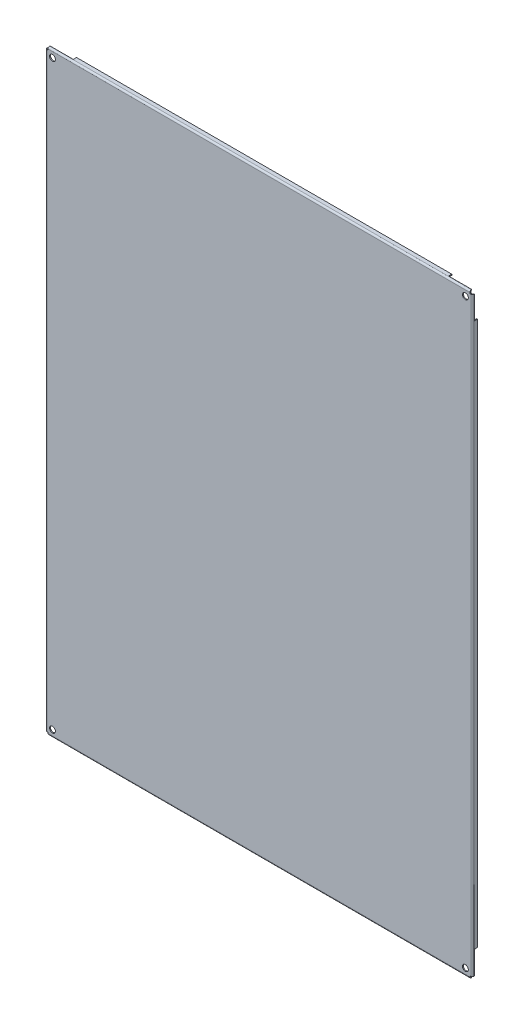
ISO-10303-21;
HEADER;
FILE_DESCRIPTION(('STEP AP214'),'2;1');
FILE_NAME('part.step','',(''),(''),'','','');
FILE_SCHEMA(('AUTOMOTIVE_DESIGN { 1 0 10303 214 1 1 1 1 }'));
ENDSEC;
DATA;
#1=APPLICATION_CONTEXT('core data for automotive mechanical design processes');
#2=APPLICATION_PROTOCOL_DEFINITION('international standard','automotive_design',2000,#1);
#3=PRODUCT_CONTEXT('',#1,'mechanical');
#4=PRODUCT('Part','Part','',(#3));
#5=PRODUCT_RELATED_PRODUCT_CATEGORY('part','',(#4));
#6=PRODUCT_DEFINITION_FORMATION('','',#4);
#7=PRODUCT_DEFINITION_CONTEXT('part definition',#1,'design');
#8=PRODUCT_DEFINITION('design','',#6,#7);
#9=PRODUCT_DEFINITION_SHAPE('','',#8);
#10=(LENGTH_UNIT() NAMED_UNIT(*) SI_UNIT(.MILLI.,.METRE.));
#11=(NAMED_UNIT(*) PLANE_ANGLE_UNIT() SI_UNIT($,.RADIAN.));
#12=(NAMED_UNIT(*) SI_UNIT($,.STERADIAN.) SOLID_ANGLE_UNIT());
#13=UNCERTAINTY_MEASURE_WITH_UNIT(LENGTH_MEASURE(1.E-05),#10,'distance_accuracy_value','');
#14=(GEOMETRIC_REPRESENTATION_CONTEXT(3) GLOBAL_UNCERTAINTY_ASSIGNED_CONTEXT((#13)) GLOBAL_UNIT_ASSIGNED_CONTEXT((#10,
#11,#12)) REPRESENTATION_CONTEXT('',''));
#15=CARTESIAN_POINT('',(0.,0.,0.));
#16=DIRECTION('',(0.,0.,1.));
#17=DIRECTION('',(1.,0.,0.));
#18=AXIS2_PLACEMENT_3D('',#15,#16,#17);
#19=CARTESIAN_POINT('',(0.,0.,0.));
#20=DIRECTION('',(0.,-1.,0.));
#21=DIRECTION('',(0.,0.,-1.));
#22=AXIS2_PLACEMENT_3D('',#19,#20,#21);
#23=PLANE('',#22);
#24=DIRECTION('',(0.,0.,1.));
#25=VECTOR('',#24,1.);
#26=CARTESIAN_POINT('',(324.585786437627,0.,0.));
#27=LINE('',#26,#25);
#28=CARTESIAN_POINT('',(324.585786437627,0.,0.999999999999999));
#29=VERTEX_POINT('',#28);
#30=CARTESIAN_POINT('',(324.585786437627,0.,1.5));
#31=VERTEX_POINT('',#30);
#32=EDGE_CURVE('E331',#29,#31,#27,.T.);
#33=ORIENTED_EDGE('',*,*,#32,.T.);
#34=DIRECTION('',(1.,0.,0.));
#35=VECTOR('',#34,1.);
#36=CARTESIAN_POINT('',(0.,0.,1.5));
#37=LINE('',#36,#35);
#38=CARTESIAN_POINT('',(-324.585786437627,0.,1.5));
#39=VERTEX_POINT('',#38);
#40=EDGE_CURVE('E326',#39,#31,#37,.T.);
#41=ORIENTED_EDGE('',*,*,#40,.F.);
#42=DIRECTION('',(0.,0.,-1.));
#43=VECTOR('',#42,1.);
#44=CARTESIAN_POINT('',(-324.585786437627,0.,0.));
#45=LINE('',#44,#43);
#46=CARTESIAN_POINT('',(-324.585786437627,0.,0.999999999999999));
#47=VERTEX_POINT('',#46);
#48=EDGE_CURVE('E320',#39,#47,#45,.T.);
#49=ORIENTED_EDGE('',*,*,#48,.T.);
#50=DIRECTION('',(-1.,0.,0.));
#51=VECTOR('',#50,1.);
#52=CARTESIAN_POINT('',(0.,0.,0.999999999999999));
#53=LINE('',#52,#51);
#54=CARTESIAN_POINT('',(-289.,0.,0.999999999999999));
#55=VERTEX_POINT('',#54);
#56=EDGE_CURVE('E323',#55,#47,#53,.T.);
#57=ORIENTED_EDGE('',*,*,#56,.F.);
#58=DIRECTION('',(0.,0.,-1.));
#59=VECTOR('',#58,1.);
#60=CARTESIAN_POINT('',(-289.,0.,0.));
#61=LINE('',#60,#59);
#62=CARTESIAN_POINT('',(-289.,0.,-4.));
#63=VERTEX_POINT('',#62);
#64=EDGE_CURVE('E392',#55,#63,#61,.T.);
#65=ORIENTED_EDGE('',*,*,#64,.T.);
#66=DIRECTION('',(1.,0.,0.));
#67=VECTOR('',#66,1.);
#68=CARTESIAN_POINT('',(0.,0.,-4.));
#69=LINE('',#68,#67);
#70=CARTESIAN_POINT('',(289.,0.,-4.));
#71=VERTEX_POINT('',#70);
#72=EDGE_CURVE('E383',#63,#71,#69,.T.);
#73=ORIENTED_EDGE('',*,*,#72,.T.);
#74=DIRECTION('',(0.,0.,1.));
#75=VECTOR('',#74,1.);
#76=CARTESIAN_POINT('',(289.,0.,0.));
#77=LINE('',#76,#75);
#78=CARTESIAN_POINT('',(289.,0.,0.999999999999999));
#79=VERTEX_POINT('',#78);
#80=EDGE_CURVE('E373',#71,#79,#77,.T.);
#81=ORIENTED_EDGE('',*,*,#80,.T.);
#82=DIRECTION('',(1.,0.,0.));
#83=VECTOR('',#82,1.);
#84=CARTESIAN_POINT('',(0.,0.,0.999999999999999));
#85=LINE('',#84,#83);
#86=EDGE_CURVE('E361',#79,#29,#85,.T.);
#87=ORIENTED_EDGE('',*,*,#86,.T.);
#88=EDGE_LOOP('',(#33,#41,#49,#57,#65,#73,#81,#87));
#89=FACE_BOUND('',#88,.T.);
#90=ADVANCED_FACE('F17',(#89),#23,.T.);
#91=CARTESIAN_POINT('',(-329.,918.,4.));
#92=DIRECTION('',(1.,0.,0.));
#93=DIRECTION('',(0.,0.,-1.));
#94=AXIS2_PLACEMENT_3D('',#91,#92,#93);
#95=PLANE('',#94);
#96=DIRECTION('',(0.,1.,0.));
#97=VECTOR('',#96,1.);
#98=CARTESIAN_POINT('',(-329.,918.,0.999999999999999));
#99=LINE('',#98,#97);
#100=CARTESIAN_POINT('',(-329.,913.585786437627,0.999999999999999));
#101=VERTEX_POINT('',#100);
#102=CARTESIAN_POINT('',(-329.,878.,0.999999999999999));
#103=VERTEX_POINT('',#102);
#104=EDGE_CURVE('E515',#101,#103,#99,.F.);
#105=ORIENTED_EDGE('',*,*,#104,.T.);
#106=DIRECTION('',(0.,0.,-1.));
#107=VECTOR('',#106,1.);
#108=CARTESIAN_POINT('',(-329.,878.,4.));
#109=LINE('',#108,#107);
#110=CARTESIAN_POINT('',(-329.,878.,-4.));
#111=VERTEX_POINT('',#110);
#112=EDGE_CURVE('E526',#103,#111,#109,.T.);
#113=ORIENTED_EDGE('',*,*,#112,.T.);
#114=DIRECTION('',(0.,1.,0.));
#115=VECTOR('',#114,1.);
#116=CARTESIAN_POINT('',(-329.,918.,-4.));
#117=LINE('',#116,#115);
#118=CARTESIAN_POINT('',(-329.,40.,-4.));
#119=VERTEX_POINT('',#118);
#120=EDGE_CURVE('E535',#111,#119,#117,.F.);
#121=ORIENTED_EDGE('',*,*,#120,.T.);
#122=DIRECTION('',(0.,0.,1.));
#123=VECTOR('',#122,1.);
#124=CARTESIAN_POINT('',(-329.,40.,4.));
#125=LINE('',#124,#123);
#126=CARTESIAN_POINT('',(-329.,40.,0.999999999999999));
#127=VERTEX_POINT('',#126);
#128=EDGE_CURVE('E523',#119,#127,#125,.T.);
#129=ORIENTED_EDGE('',*,*,#128,.T.);
#130=DIRECTION('',(0.,1.,0.));
#131=VECTOR('',#130,1.);
#132=CARTESIAN_POINT('',(-329.,918.,0.999999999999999));
#133=LINE('',#132,#131);
#134=CARTESIAN_POINT('',(-329.,4.41421356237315,0.999999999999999));
#135=VERTEX_POINT('',#134);
#136=EDGE_CURVE('E345',#135,#127,#133,.T.);
#137=ORIENTED_EDGE('',*,*,#136,.F.);
#138=DIRECTION('',(0.,0.,-1.));
#139=VECTOR('',#138,1.);
#140=CARTESIAN_POINT('',(-329.,4.41421356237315,4.));
#141=LINE('',#140,#139);
#142=CARTESIAN_POINT('',(-329.,4.41421356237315,1.5));
#143=VERTEX_POINT('',#142);
#144=EDGE_CURVE('E532',#143,#135,#141,.T.);
#145=ORIENTED_EDGE('',*,*,#144,.F.);
#146=DIRECTION('',(0.,1.,0.));
#147=VECTOR('',#146,1.);
#148=CARTESIAN_POINT('',(-329.,918.,1.5));
#149=LINE('',#148,#147);
#150=CARTESIAN_POINT('',(-329.,913.585786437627,1.5));
#151=VERTEX_POINT('',#150);
#152=EDGE_CURVE('E1172',#151,#143,#149,.F.);
#153=ORIENTED_EDGE('',*,*,#152,.F.);
#154=DIRECTION('',(0.,0.,1.));
#155=VECTOR('',#154,1.);
#156=CARTESIAN_POINT('',(-329.,913.585786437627,2.5));
#157=LINE('',#156,#155);
#158=EDGE_CURVE('E1177',#101,#151,#157,.T.);
#159=ORIENTED_EDGE('',*,*,#158,.F.);
#160=EDGE_LOOP('',(#105,#113,#121,#129,#137,#145,#153,#159));
#161=FACE_BOUND('',#160,.T.);
#162=ADVANCED_FACE('F808',(#161),#95,.F.);
#163=CARTESIAN_POINT('',(0.,918.,0.));
#164=DIRECTION('',(0.,-1.,0.));
#165=DIRECTION('',(0.,0.,-1.));
#166=AXIS2_PLACEMENT_3D('',#163,#164,#165);
#167=PLANE('',#166);
#168=DIRECTION('',(-1.,0.,0.));
#169=VECTOR('',#168,1.);
#170=CARTESIAN_POINT('',(0.,918.,0.999999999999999));
#171=LINE('',#170,#169);
#172=CARTESIAN_POINT('',(289.,918.,0.999999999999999));
#173=VERTEX_POINT('',#172);
#174=CARTESIAN_POINT('',(324.585786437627,918.,0.999999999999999));
#175=VERTEX_POINT('',#174);
#176=EDGE_CURVE('E500',#173,#175,#171,.F.);
#177=ORIENTED_EDGE('',*,*,#176,.F.);
#178=DIRECTION('',(0.,0.,1.));
#179=VECTOR('',#178,1.);
#180=CARTESIAN_POINT('',(289.,918.,0.));
#181=LINE('',#180,#179);
#182=CARTESIAN_POINT('',(289.,918.,-4.));
#183=VERTEX_POINT('',#182);
#184=EDGE_CURVE('E1154',#173,#183,#181,.F.);
#185=ORIENTED_EDGE('',*,*,#184,.T.);
#186=DIRECTION('',(1.,0.,0.));
#187=VECTOR('',#186,1.);
#188=CARTESIAN_POINT('',(0.,918.,-4.));
#189=LINE('',#188,#187);
#190=CARTESIAN_POINT('',(-289.,918.,-4.));
#191=VERTEX_POINT('',#190);
#192=EDGE_CURVE('E493',#183,#191,#189,.F.);
#193=ORIENTED_EDGE('',*,*,#192,.T.);
#194=DIRECTION('',(0.,0.,-1.));
#195=VECTOR('',#194,1.);
#196=CARTESIAN_POINT('',(-289.,918.,0.));
#197=LINE('',#196,#195);
#198=CARTESIAN_POINT('',(-289.,918.,0.999999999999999));
#199=VERTEX_POINT('',#198);
#200=EDGE_CURVE('E481',#191,#199,#197,.F.);
#201=ORIENTED_EDGE('',*,*,#200,.T.);
#202=DIRECTION('',(1.,0.,0.));
#203=VECTOR('',#202,1.);
#204=CARTESIAN_POINT('',(0.,918.,0.999999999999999));
#205=LINE('',#204,#203);
#206=CARTESIAN_POINT('',(-324.585786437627,918.,0.999999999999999));
#207=VERTEX_POINT('',#206);
#208=EDGE_CURVE('E478',#199,#207,#205,.F.);
#209=ORIENTED_EDGE('',*,*,#208,.T.);
#210=DIRECTION('',(0.,0.,-1.));
#211=VECTOR('',#210,1.);
#212=CARTESIAN_POINT('',(-324.585786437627,918.,0.));
#213=LINE('',#212,#211);
#214=CARTESIAN_POINT('',(-324.585786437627,918.,1.5));
#215=VERTEX_POINT('',#214);
#216=EDGE_CURVE('E449',#215,#207,#213,.T.);
#217=ORIENTED_EDGE('',*,*,#216,.F.);
#218=DIRECTION('',(-1.,0.,0.));
#219=VECTOR('',#218,1.);
#220=CARTESIAN_POINT('',(-329.,918.,1.5));
#221=LINE('',#220,#219);
#222=CARTESIAN_POINT('',(324.585786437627,918.,1.5));
#223=VERTEX_POINT('',#222);
#224=EDGE_CURVE('E499',#223,#215,#221,.T.);
#225=ORIENTED_EDGE('',*,*,#224,.F.);
#226=DIRECTION('',(0.,0.,-1.));
#227=VECTOR('',#226,1.);
#228=CARTESIAN_POINT('',(324.585786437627,918.,2.5));
#229=LINE('',#228,#227);
#230=EDGE_CURVE('E1167',#175,#223,#229,.F.);
#231=ORIENTED_EDGE('',*,*,#230,.F.);
#232=EDGE_LOOP('',(#177,#185,#193,#201,#209,#217,#225,#231));
#233=FACE_BOUND('',#232,.T.);
#234=ADVANCED_FACE('F811',(#233),#167,.F.);
#235=CARTESIAN_POINT('',(329.,918.,4.));
#236=DIRECTION('',(-1.,0.,0.));
#237=DIRECTION('',(0.,0.,1.));
#238=AXIS2_PLACEMENT_3D('',#235,#236,#237);
#239=PLANE('',#238);
#240=DIRECTION('',(0.,1.,0.));
#241=VECTOR('',#240,1.);
#242=CARTESIAN_POINT('',(329.,918.,0.999999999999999));
#243=LINE('',#242,#241);
#244=CARTESIAN_POINT('',(329.,4.41421356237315,0.999999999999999));
#245=VERTEX_POINT('',#244);
#246=CARTESIAN_POINT('',(329.,40.,0.999999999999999));
#247=VERTEX_POINT('',#246);
#248=EDGE_CURVE('E463',#245,#247,#243,.T.);
#249=ORIENTED_EDGE('',*,*,#248,.T.);
#250=DIRECTION('',(0.,0.,1.));
#251=VECTOR('',#250,1.);
#252=CARTESIAN_POINT('',(329.,40.,4.));
#253=LINE('',#252,#251);
#254=CARTESIAN_POINT('',(329.,40.,-4.));
#255=VERTEX_POINT('',#254);
#256=EDGE_CURVE('E1127',#247,#255,#253,.F.);
#257=ORIENTED_EDGE('',*,*,#256,.T.);
#258=DIRECTION('',(0.,1.,0.));
#259=VECTOR('',#258,1.);
#260=CARTESIAN_POINT('',(329.,918.,-4.));
#261=LINE('',#260,#259);
#262=CARTESIAN_POINT('',(329.,878.,-4.));
#263=VERTEX_POINT('',#262);
#264=EDGE_CURVE('E1129',#263,#255,#261,.F.);
#265=ORIENTED_EDGE('',*,*,#264,.F.);
#266=DIRECTION('',(0.,0.,-1.));
#267=VECTOR('',#266,1.);
#268=CARTESIAN_POINT('',(329.,878.,4.));
#269=LINE('',#268,#267);
#270=CARTESIAN_POINT('',(329.,878.,0.999999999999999));
#271=VERTEX_POINT('',#270);
#272=EDGE_CURVE('E444',#263,#271,#269,.F.);
#273=ORIENTED_EDGE('',*,*,#272,.T.);
#274=DIRECTION('',(0.,1.,0.));
#275=VECTOR('',#274,1.);
#276=CARTESIAN_POINT('',(329.,918.,0.999999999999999));
#277=LINE('',#276,#275);
#278=CARTESIAN_POINT('',(329.,913.585786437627,0.999999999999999));
#279=VERTEX_POINT('',#278);
#280=EDGE_CURVE('E441',#279,#271,#277,.F.);
#281=ORIENTED_EDGE('',*,*,#280,.F.);
#282=DIRECTION('',(0.,0.,1.));
#283=VECTOR('',#282,1.);
#284=CARTESIAN_POINT('',(329.,913.585786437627,4.));
#285=LINE('',#284,#283);
#286=CARTESIAN_POINT('',(329.,913.585786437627,1.5));
#287=VERTEX_POINT('',#286);
#288=EDGE_CURVE('E160',#287,#279,#285,.F.);
#289=ORIENTED_EDGE('',*,*,#288,.F.);
#290=DIRECTION('',(0.,1.,0.));
#291=VECTOR('',#290,1.);
#292=CARTESIAN_POINT('',(329.,918.,1.5));
#293=LINE('',#292,#291);
#294=CARTESIAN_POINT('',(329.,4.41421356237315,1.5));
#295=VERTEX_POINT('',#294);
#296=EDGE_CURVE('E1122',#295,#287,#293,.T.);
#297=ORIENTED_EDGE('',*,*,#296,.F.);
#298=DIRECTION('',(0.,0.,-1.));
#299=VECTOR('',#298,1.);
#300=CARTESIAN_POINT('',(329.,4.41421356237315,4.));
#301=LINE('',#300,#299);
#302=EDGE_CURVE('E962',#245,#295,#301,.F.);
#303=ORIENTED_EDGE('',*,*,#302,.F.);
#304=EDGE_LOOP('',(#249,#257,#265,#273,#281,#289,#297,#303));
#305=FACE_BOUND('',#304,.T.);
#306=ADVANCED_FACE('F815',(#305),#239,.F.);
#307=CARTESIAN_POINT('',(0.,1.5,0.999999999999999));
#308=DIRECTION('',(0.,0.,-1.));
#309=DIRECTION('',(-1.,0.,0.));
#310=AXIS2_PLACEMENT_3D('',#307,#308,#309);
#311=PLANE('',#310);
#312=DIRECTION('',(0.,1.,0.));
#313=VECTOR('',#312,1.);
#314=CARTESIAN_POINT('',(-324.585786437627,1.5,0.999999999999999));
#315=LINE('',#314,#313);
#316=CARTESIAN_POINT('',(-324.585786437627,1.5,0.999999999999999));
#317=VERTEX_POINT('',#316);
#318=EDGE_CURVE('E330',#47,#317,#315,.T.);
#319=ORIENTED_EDGE('',*,*,#318,.T.);
#320=DIRECTION('',(1.,0.,0.));
#321=VECTOR('',#320,1.);
#322=CARTESIAN_POINT('',(0.,1.5,0.999999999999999));
#323=LINE('',#322,#321);
#324=CARTESIAN_POINT('',(-289.,1.5,0.999999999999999));
#325=VERTEX_POINT('',#324);
#326=EDGE_CURVE('E353',#317,#325,#323,.T.);
#327=ORIENTED_EDGE('',*,*,#326,.T.);
#328=DIRECTION('',(0.,1.,0.));
#329=VECTOR('',#328,1.);
#330=CARTESIAN_POINT('',(-289.,1.5,0.999999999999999));
#331=LINE('',#330,#329);
#332=EDGE_CURVE('E337',#325,#55,#331,.F.);
#333=ORIENTED_EDGE('',*,*,#332,.T.);
#334=ORIENTED_EDGE('',*,*,#56,.T.);
#335=EDGE_LOOP('',(#319,#327,#333,#334));
#336=FACE_BOUND('',#335,.T.);
#337=ADVANCED_FACE('F334',(#336),#311,.T.);
#338=CARTESIAN_POINT('',(-289.,1.5,0.));
#339=DIRECTION('',(1.,0.,0.));
#340=DIRECTION('',(0.,0.,-1.));
#341=AXIS2_PLACEMENT_3D('',#338,#339,#340);
#342=PLANE('',#341);
#343=ORIENTED_EDGE('',*,*,#64,.F.);
#344=ORIENTED_EDGE('',*,*,#332,.F.);
#345=DIRECTION('',(0.,0.,-1.));
#346=VECTOR('',#345,1.);
#347=CARTESIAN_POINT('',(-289.,1.5,0.));
#348=LINE('',#347,#346);
#349=CARTESIAN_POINT('',(-289.,1.5,-4.));
#350=VERTEX_POINT('',#349);
#351=EDGE_CURVE('E355',#325,#350,#348,.T.);
#352=ORIENTED_EDGE('',*,*,#351,.T.);
#353=DIRECTION('',(0.,1.,0.));
#354=VECTOR('',#353,1.);
#355=CARTESIAN_POINT('',(-289.,1.5,-4.));
#356=LINE('',#355,#354);
#357=EDGE_CURVE('E389',#350,#63,#356,.F.);
#358=ORIENTED_EDGE('',*,*,#357,.T.);
#359=EDGE_LOOP('',(#343,#344,#352,#358));
#360=FACE_BOUND('',#359,.T.);
#361=ADVANCED_FACE('F822',(#360),#342,.F.);
#362=CARTESIAN_POINT('',(0.,1.5,-4.));
#363=DIRECTION('',(0.,0.,1.));
#364=DIRECTION('',(1.,0.,0.));
#365=AXIS2_PLACEMENT_3D('',#362,#363,#364);
#366=PLANE('',#365);
#367=ORIENTED_EDGE('',*,*,#72,.F.);
#368=ORIENTED_EDGE('',*,*,#357,.F.);
#369=DIRECTION('',(1.,0.,0.));
#370=VECTOR('',#369,1.);
#371=CARTESIAN_POINT('',(0.,1.5,-4.));
#372=LINE('',#371,#370);
#373=CARTESIAN_POINT('',(289.,1.5,-4.));
#374=VERTEX_POINT('',#373);
#375=EDGE_CURVE('E377',#350,#374,#372,.T.);
#376=ORIENTED_EDGE('',*,*,#375,.T.);
#377=DIRECTION('',(0.,1.,0.));
#378=VECTOR('',#377,1.);
#379=CARTESIAN_POINT('',(289.,1.5,-4.));
#380=LINE('',#379,#378);
#381=EDGE_CURVE('E380',#374,#71,#380,.F.);
#382=ORIENTED_EDGE('',*,*,#381,.T.);
#383=EDGE_LOOP('',(#367,#368,#376,#382));
#384=FACE_BOUND('',#383,.T.);
#385=ADVANCED_FACE('F825',(#384),#366,.F.);
#386=CARTESIAN_POINT('',(289.,1.5,0.));
#387=DIRECTION('',(-1.,0.,0.));
#388=DIRECTION('',(0.,0.,1.));
#389=AXIS2_PLACEMENT_3D('',#386,#387,#388);
#390=PLANE('',#389);
#391=ORIENTED_EDGE('',*,*,#80,.F.);
#392=ORIENTED_EDGE('',*,*,#381,.F.);
#393=DIRECTION('',(0.,0.,-1.));
#394=VECTOR('',#393,1.);
#395=CARTESIAN_POINT('',(289.,1.5,0.));
#396=LINE('',#395,#394);
#397=CARTESIAN_POINT('',(289.,1.5,0.999999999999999));
#398=VERTEX_POINT('',#397);
#399=EDGE_CURVE('E367',#374,#398,#396,.F.);
#400=ORIENTED_EDGE('',*,*,#399,.T.);
#401=DIRECTION('',(0.,1.,0.));
#402=VECTOR('',#401,1.);
#403=CARTESIAN_POINT('',(289.,1.5,0.999999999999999));
#404=LINE('',#403,#402);
#405=EDGE_CURVE('E370',#398,#79,#404,.F.);
#406=ORIENTED_EDGE('',*,*,#405,.T.);
#407=EDGE_LOOP('',(#391,#392,#400,#406));
#408=FACE_BOUND('',#407,.T.);
#409=ADVANCED_FACE('F829',(#408),#390,.F.);
#410=CARTESIAN_POINT('',(0.,1.5,0.999999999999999));
#411=DIRECTION('',(0.,0.,1.));
#412=DIRECTION('',(1.,0.,0.));
#413=AXIS2_PLACEMENT_3D('',#410,#411,#412);
#414=PLANE('',#413);
#415=ORIENTED_EDGE('',*,*,#86,.F.);
#416=ORIENTED_EDGE('',*,*,#405,.F.);
#417=DIRECTION('',(1.,0.,0.));
#418=VECTOR('',#417,1.);
#419=CARTESIAN_POINT('',(0.,1.5,0.999999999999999));
#420=LINE('',#419,#418);
#421=CARTESIAN_POINT('',(324.585786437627,1.5,0.999999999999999));
#422=VERTEX_POINT('',#421);
#423=EDGE_CURVE('E364',#398,#422,#420,.T.);
#424=ORIENTED_EDGE('',*,*,#423,.T.);
#425=DIRECTION('',(0.,1.,0.));
#426=VECTOR('',#425,1.);
#427=CARTESIAN_POINT('',(324.585786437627,1.5,0.999999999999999));
#428=LINE('',#427,#426);
#429=EDGE_CURVE('E358',#422,#29,#428,.F.);
#430=ORIENTED_EDGE('',*,*,#429,.T.);
#431=EDGE_LOOP('',(#415,#416,#424,#430));
#432=FACE_BOUND('',#431,.T.);
#433=ADVANCED_FACE('F833',(#432),#414,.F.);
#434=CARTESIAN_POINT('',(324.585786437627,1.5,0.));
#435=DIRECTION('',(-1.,0.,0.));
#436=DIRECTION('',(0.,0.,1.));
#437=AXIS2_PLACEMENT_3D('',#434,#435,#436);
#438=PLANE('',#437);
#439=ORIENTED_EDGE('',*,*,#32,.F.);
#440=ORIENTED_EDGE('',*,*,#429,.F.);
#441=DIRECTION('',(0.,0.,-1.));
#442=VECTOR('',#441,1.);
#443=CARTESIAN_POINT('',(324.585786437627,1.5,0.));
#444=LINE('',#443,#442);
#445=CARTESIAN_POINT('',(324.585786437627,1.5,1.5));
#446=VERTEX_POINT('',#445);
#447=EDGE_CURVE('E366',#422,#446,#444,.F.);
#448=ORIENTED_EDGE('',*,*,#447,.T.);
#449=DIRECTION('',(0.,1.,0.));
#450=VECTOR('',#449,1.);
#451=CARTESIAN_POINT('',(324.585786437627,0.75,1.5));
#452=LINE('',#451,#450);
#453=EDGE_CURVE('E1113',#31,#446,#452,.T.);
#454=ORIENTED_EDGE('',*,*,#453,.F.);
#455=EDGE_LOOP('',(#439,#440,#448,#454));
#456=FACE_BOUND('',#455,.T.);
#457=ADVANCED_FACE('F837',(#456),#438,.F.);
#458=CARTESIAN_POINT('',(-324.585786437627,1.5,0.));
#459=DIRECTION('',(1.,0.,0.));
#460=DIRECTION('',(0.,0.,-1.));
#461=AXIS2_PLACEMENT_3D('',#458,#459,#460);
#462=PLANE('',#461);
#463=ORIENTED_EDGE('',*,*,#48,.F.);
#464=DIRECTION('',(0.,-1.,0.));
#465=VECTOR('',#464,1.);
#466=CARTESIAN_POINT('',(-324.585786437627,0.75,1.5));
#467=LINE('',#466,#465);
#468=CARTESIAN_POINT('',(-324.585786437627,1.5,1.5));
#469=VERTEX_POINT('',#468);
#470=EDGE_CURVE('E1110',#469,#39,#467,.T.);
#471=ORIENTED_EDGE('',*,*,#470,.F.);
#472=DIRECTION('',(0.,0.,-1.));
#473=VECTOR('',#472,1.);
#474=CARTESIAN_POINT('',(-324.585786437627,1.5,0.));
#475=LINE('',#474,#473);
#476=EDGE_CURVE('E342',#469,#317,#475,.T.);
#477=ORIENTED_EDGE('',*,*,#476,.T.);
#478=ORIENTED_EDGE('',*,*,#318,.F.);
#479=EDGE_LOOP('',(#463,#471,#477,#478));
#480=FACE_BOUND('',#479,.T.);
#481=ADVANCED_FACE('F340',(#480),#462,.F.);
#482=CARTESIAN_POINT('',(0.,2.5,1.5));
#483=DIRECTION('',(1.,0.,0.));
#484=DIRECTION('',(0.,0.,-1.));
#485=AXIS2_PLACEMENT_3D('',#482,#483,#484);
#486=CYLINDRICAL_SURFACE('',#485,2.5);
#487=CARTESIAN_POINT('',(325.,2.5,4.));
#488=CARTESIAN_POINT('',(324.999990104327,2.43503514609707,4.00000716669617));
#489=CARTESIAN_POINT('',(324.998839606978,2.3700851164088,3.99746790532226));
#490=CARTESIAN_POINT('',(324.994583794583,2.24066759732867,3.98735772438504));
#491=CARTESIAN_POINT('',(324.991479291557,2.17619991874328,3.97978889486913));
#492=CARTESIAN_POINT('',(324.983649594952,2.04828077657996,3.95970195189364));
#493=CARTESIAN_POINT('',(324.978927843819,1.98482745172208,3.94719434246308));
#494=CARTESIAN_POINT('',(324.96812996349,1.85919674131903,3.91734262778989));
#495=CARTESIAN_POINT('',(324.962053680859,1.79701950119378,3.8999979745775));
#496=CARTESIAN_POINT('',(324.941762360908,1.60919599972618,3.83967369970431));
#497=CARTESIAN_POINT('',(324.925746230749,1.48611584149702,3.78900635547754));
#498=CARTESIAN_POINT('',(324.89083277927,1.24986252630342,3.66904322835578));
#499=CARTESIAN_POINT('',(324.871933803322,1.13669511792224,3.59973672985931));
#500=CARTESIAN_POINT('',(324.831621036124,0.916713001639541,3.43977461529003));
#501=CARTESIAN_POINT('',(324.810125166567,0.810635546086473,3.34812208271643));
#502=CARTESIAN_POINT('',(324.767235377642,0.615222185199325,3.14837717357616));
#503=CARTESIAN_POINT('',(324.745841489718,0.525891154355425,3.04028002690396));
#504=CARTESIAN_POINT('',(324.704466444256,0.3649971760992,2.80844024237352));
#505=CARTESIAN_POINT('',(324.684516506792,0.293772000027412,2.68445721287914));
#506=CARTESIAN_POINT('',(324.648372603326,0.173363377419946,2.42578882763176));
#507=CARTESIAN_POINT('',(324.632175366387,0.124160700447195,2.29111293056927));
#508=CARTESIAN_POINT('',(324.608970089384,0.0580945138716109,2.04696003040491));
#509=CARTESIAN_POINT('',(324.60070102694,0.0363713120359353,1.93890652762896));
#510=CARTESIAN_POINT('',(324.592011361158,0.0145839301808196,1.77521638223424));
#511=CARTESIAN_POINT('',(324.589733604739,0.00912101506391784,1.72035946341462));
#512=CARTESIAN_POINT('',(324.586623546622,0.00182730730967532,1.61034185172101));
#513=CARTESIAN_POINT('',(324.585791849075,-1.96727089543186E-06,1.55518104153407));
#514=CARTESIAN_POINT('',(324.585786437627,0.,1.5));
#515=B_SPLINE_CURVE_WITH_KNOTS('',3,(#487,#488,#489,#490,#491,#492,#493,#494,#495,#496,#497,
#498,#499,#500,#501,#502,#503,#504,#505,#506,#507,#508,#509,#510,#511,#512,#513,#514),
.UNSPECIFIED.,.F.,.F.,(4,2,2,2,2,2,2,2,2,2,2,2,2,4),(0.,0.194812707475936,0.389544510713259,
0.583864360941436,0.778206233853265,1.17849622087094,1.579016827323,2.00252209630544,
2.42615044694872,2.85718159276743,3.28783561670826,3.61833762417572,3.78373858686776,
3.94920863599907),.UNSPECIFIED.);
#516=CARTESIAN_POINT('',(325.,2.49999999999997,4.));
#517=VERTEX_POINT('',#516);
#518=EDGE_CURVE('E24',#517,#31,#515,.T.);
#519=ORIENTED_EDGE('',*,*,#518,.F.);
#520=DIRECTION('',(-1.,0.,0.));
#521=VECTOR('',#520,1.);
#522=CARTESIAN_POINT('',(-329.,2.49999999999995,4.));
#523=LINE('',#522,#521);
#524=CARTESIAN_POINT('',(-325.,2.49999999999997,4.));
#525=VERTEX_POINT('',#524);
#526=EDGE_CURVE('E409',#517,#525,#523,.T.);
#527=ORIENTED_EDGE('',*,*,#526,.T.);
#528=CARTESIAN_POINT('',(-324.585786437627,0.,1.5));
#529=CARTESIAN_POINT('',(-324.5857963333,-7.16669616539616E-06,1.56496485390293));
#530=CARTESIAN_POINT('',(-324.586946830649,0.00253209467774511,1.6299148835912));
#531=CARTESIAN_POINT('',(-324.591202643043,0.01264227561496,1.75933240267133));
#532=CARTESIAN_POINT('',(-324.59430714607,0.0202111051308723,1.82380008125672));
#533=CARTESIAN_POINT('',(-324.602136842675,0.0402980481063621,1.95171922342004));
#534=CARTESIAN_POINT('',(-324.606858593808,0.0528056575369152,2.01517254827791));
#535=CARTESIAN_POINT('',(-324.617656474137,0.082657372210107,2.14080325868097));
#536=CARTESIAN_POINT('',(-324.623732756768,0.100002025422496,2.20298049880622));
#537=CARTESIAN_POINT('',(-324.644024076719,0.160326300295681,2.3908040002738));
#538=CARTESIAN_POINT('',(-324.660040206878,0.210993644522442,2.51388415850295));
#539=CARTESIAN_POINT('',(-324.694953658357,0.330956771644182,2.75013747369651));
#540=CARTESIAN_POINT('',(-324.713852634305,0.400263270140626,2.86330488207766));
#541=CARTESIAN_POINT('',(-324.754165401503,0.560225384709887,3.08328699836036));
#542=CARTESIAN_POINT('',(-324.77566127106,0.6518779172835,3.18936445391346));
#543=CARTESIAN_POINT('',(-324.818551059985,0.851622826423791,3.38477781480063));
#544=CARTESIAN_POINT('',(-324.839944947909,0.959719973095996,3.47410884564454));
#545=CARTESIAN_POINT('',(-324.88131999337,1.19155975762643,3.63500282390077));
#546=CARTESIAN_POINT('',(-324.901269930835,1.31554278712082,3.70622799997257));
#547=CARTESIAN_POINT('',(-324.9374138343,1.5742111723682,3.82663662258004));
#548=CARTESIAN_POINT('',(-324.95361107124,1.7088870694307,3.87583929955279));
#549=CARTESIAN_POINT('',(-324.976816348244,1.95303996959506,3.94190548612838));
#550=CARTESIAN_POINT('',(-324.985085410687,2.061093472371,3.96362868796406));
#551=CARTESIAN_POINT('',(-324.993775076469,2.22478361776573,3.98541606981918));
#552=CARTESIAN_POINT('',(-324.996052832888,2.27964053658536,3.99087898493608));
#553=CARTESIAN_POINT('',(-324.999162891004,2.38965814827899,3.99817269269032));
#554=CARTESIAN_POINT('',(-324.999994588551,2.44481895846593,4.0000019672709));
#555=CARTESIAN_POINT('',(-325.,2.5,4.));
#556=B_SPLINE_CURVE_WITH_KNOTS('',3,(#528,#529,#530,#531,#532,#533,#534,#535,#536,#537,#538,
#539,#540,#541,#542,#543,#544,#545,#546,#547,#548,#549,#550,#551,#552,#553,#554,#555),
.UNSPECIFIED.,.F.,.F.,(4,2,2,2,2,2,2,2,2,2,2,2,2,4),(0.,0.194812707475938,0.38954451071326,
0.583864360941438,0.778206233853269,1.17849622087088,1.57901682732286,2.00252209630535,
2.42615044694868,2.85718159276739,3.28783561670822,3.6183376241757,3.78373858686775,
3.94920863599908),.UNSPECIFIED.);
#557=EDGE_CURVE('E728',#39,#525,#556,.T.);
#558=ORIENTED_EDGE('',*,*,#557,.F.);
#559=ORIENTED_EDGE('',*,*,#40,.T.);
#560=EDGE_LOOP('',(#519,#527,#558,#559));
#561=FACE_BOUND('',#560,.T.);
#562=ADVANCED_FACE('F843',(#561),#486,.T.);
#563=CARTESIAN_POINT('',(-327.5,918.,0.999999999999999));
#564=DIRECTION('',(0.,0.,-1.));
#565=DIRECTION('',(-1.,0.,0.));
#566=AXIS2_PLACEMENT_3D('',#563,#564,#565);
#567=PLANE('',#566);
#568=DIRECTION('',(1.,0.,0.));
#569=VECTOR('',#568,1.);
#570=CARTESIAN_POINT('',(-327.5,40.,0.999999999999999));
#571=LINE('',#570,#569);
#572=CARTESIAN_POINT('',(-327.5,40.,0.999999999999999));
#573=VERTEX_POINT('',#572);
#574=EDGE_CURVE('E537',#127,#573,#571,.T.);
#575=ORIENTED_EDGE('',*,*,#574,.T.);
#576=DIRECTION('',(0.,1.,0.));
#577=VECTOR('',#576,1.);
#578=CARTESIAN_POINT('',(-327.5,918.,0.999999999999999));
#579=LINE('',#578,#577);
#580=CARTESIAN_POINT('',(-327.5,4.41421356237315,0.999999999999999));
#581=VERTEX_POINT('',#580);
#582=EDGE_CURVE('E1097',#581,#573,#579,.T.);
#583=ORIENTED_EDGE('',*,*,#582,.F.);
#584=DIRECTION('',(1.,0.,0.));
#585=VECTOR('',#584,1.);
#586=CARTESIAN_POINT('',(-327.5,4.41421356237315,0.999999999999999));
#587=LINE('',#586,#585);
#588=EDGE_CURVE('E1185',#135,#581,#587,.T.);
#589=ORIENTED_EDGE('',*,*,#588,.F.);
#590=ORIENTED_EDGE('',*,*,#136,.T.);
#591=EDGE_LOOP('',(#575,#583,#589,#590));
#592=FACE_BOUND('',#591,.T.);
#593=ADVANCED_FACE('F847',(#592),#567,.T.);
#594=CARTESIAN_POINT('',(-327.5,40.,4.));
#595=DIRECTION('',(0.,1.,0.));
#596=DIRECTION('',(0.,0.,1.));
#597=AXIS2_PLACEMENT_3D('',#594,#595,#596);
#598=PLANE('',#597);
#599=ORIENTED_EDGE('',*,*,#128,.F.);
#600=DIRECTION('',(1.,0.,0.));
#601=VECTOR('',#600,1.);
#602=CARTESIAN_POINT('',(-327.5,40.,-4.));
#603=LINE('',#602,#601);
#604=CARTESIAN_POINT('',(-327.5,40.,-4.));
#605=VERTEX_POINT('',#604);
#606=EDGE_CURVE('E528',#119,#605,#603,.T.);
#607=ORIENTED_EDGE('',*,*,#606,.T.);
#608=DIRECTION('',(0.,0.,-1.));
#609=VECTOR('',#608,1.);
#610=CARTESIAN_POINT('',(-327.5,40.,4.));
#611=LINE('',#610,#609);
#612=EDGE_CURVE('E1094',#573,#605,#611,.T.);
#613=ORIENTED_EDGE('',*,*,#612,.F.);
#614=ORIENTED_EDGE('',*,*,#574,.F.);
#615=EDGE_LOOP('',(#599,#607,#613,#614));
#616=FACE_BOUND('',#615,.T.);
#617=ADVANCED_FACE('F852',(#616),#598,.F.);
#618=CARTESIAN_POINT('',(-327.5,918.,-4.));
#619=DIRECTION('',(0.,0.,1.));
#620=DIRECTION('',(1.,0.,0.));
#621=AXIS2_PLACEMENT_3D('',#618,#619,#620);
#622=PLANE('',#621);
#623=ORIENTED_EDGE('',*,*,#120,.F.);
#624=DIRECTION('',(1.,0.,0.));
#625=VECTOR('',#624,1.);
#626=CARTESIAN_POINT('',(-327.5,878.,-4.));
#627=LINE('',#626,#625);
#628=CARTESIAN_POINT('',(-327.5,878.,-4.));
#629=VERTEX_POINT('',#628);
#630=EDGE_CURVE('E518',#111,#629,#627,.T.);
#631=ORIENTED_EDGE('',*,*,#630,.T.);
#632=DIRECTION('',(0.,1.,0.));
#633=VECTOR('',#632,1.);
#634=CARTESIAN_POINT('',(-327.5,918.,-4.));
#635=LINE('',#634,#633);
#636=EDGE_CURVE('E1091',#605,#629,#635,.T.);
#637=ORIENTED_EDGE('',*,*,#636,.F.);
#638=ORIENTED_EDGE('',*,*,#606,.F.);
#639=EDGE_LOOP('',(#623,#631,#637,#638));
#640=FACE_BOUND('',#639,.T.);
#641=ADVANCED_FACE('F856',(#640),#622,.F.);
#642=CARTESIAN_POINT('',(-327.5,878.,4.));
#643=DIRECTION('',(0.,-1.,0.));
#644=DIRECTION('',(0.,0.,-1.));
#645=AXIS2_PLACEMENT_3D('',#642,#643,#644);
#646=PLANE('',#645);
#647=ORIENTED_EDGE('',*,*,#112,.F.);
#648=DIRECTION('',(1.,0.,0.));
#649=VECTOR('',#648,1.);
#650=CARTESIAN_POINT('',(-327.5,878.,0.999999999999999));
#651=LINE('',#650,#649);
#652=CARTESIAN_POINT('',(-327.5,878.,0.999999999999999));
#653=VERTEX_POINT('',#652);
#654=EDGE_CURVE('E517',#103,#653,#651,.T.);
#655=ORIENTED_EDGE('',*,*,#654,.T.);
#656=DIRECTION('',(0.,0.,-1.));
#657=VECTOR('',#656,1.);
#658=CARTESIAN_POINT('',(-327.5,878.,4.));
#659=LINE('',#658,#657);
#660=EDGE_CURVE('E1088',#629,#653,#659,.F.);
#661=ORIENTED_EDGE('',*,*,#660,.F.);
#662=ORIENTED_EDGE('',*,*,#630,.F.);
#663=EDGE_LOOP('',(#647,#655,#661,#662));
#664=FACE_BOUND('',#663,.T.);
#665=ADVANCED_FACE('F860',(#664),#646,.F.);
#666=CARTESIAN_POINT('',(-327.5,918.,0.999999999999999));
#667=DIRECTION('',(0.,0.,1.));
#668=DIRECTION('',(1.,0.,0.));
#669=AXIS2_PLACEMENT_3D('',#666,#667,#668);
#670=PLANE('',#669);
#671=ORIENTED_EDGE('',*,*,#104,.F.);
#672=DIRECTION('',(1.,0.,0.));
#673=VECTOR('',#672,1.);
#674=CARTESIAN_POINT('',(-327.5,913.585786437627,0.999999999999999));
#675=LINE('',#674,#673);
#676=CARTESIAN_POINT('',(-327.5,913.585786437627,0.999999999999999));
#677=VERTEX_POINT('',#676);
#678=EDGE_CURVE('E1180',#677,#101,#675,.F.);
#679=ORIENTED_EDGE('',*,*,#678,.F.);
#680=DIRECTION('',(0.,1.,0.));
#681=VECTOR('',#680,1.);
#682=CARTESIAN_POINT('',(-327.5,918.,0.999999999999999));
#683=LINE('',#682,#681);
#684=EDGE_CURVE('E727',#653,#677,#683,.T.);
#685=ORIENTED_EDGE('',*,*,#684,.F.);
#686=ORIENTED_EDGE('',*,*,#654,.F.);
#687=EDGE_LOOP('',(#671,#679,#685,#686));
#688=FACE_BOUND('',#687,.T.);
#689=ADVANCED_FACE('F864',(#688),#670,.F.);
#690=CARTESIAN_POINT('',(-327.5,4.41421356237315,4.));
#691=DIRECTION('',(0.,-1.,0.));
#692=DIRECTION('',(0.,0.,-1.));
#693=AXIS2_PLACEMENT_3D('',#690,#691,#692);
#694=PLANE('',#693);
#695=ORIENTED_EDGE('',*,*,#588,.T.);
#696=DIRECTION('',(0.,0.,-1.));
#697=VECTOR('',#696,1.);
#698=CARTESIAN_POINT('',(-327.5,4.41421356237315,4.));
#699=LINE('',#698,#697);
#700=CARTESIAN_POINT('',(-327.5,4.41421356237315,1.5));
#701=VERTEX_POINT('',#700);
#702=EDGE_CURVE('E1101',#701,#581,#699,.T.);
#703=ORIENTED_EDGE('',*,*,#702,.F.);
#704=DIRECTION('',(1.,0.,0.));
#705=VECTOR('',#704,1.);
#706=CARTESIAN_POINT('',(-328.25,4.41421356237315,1.5));
#707=LINE('',#706,#705);
#708=EDGE_CURVE('E726',#143,#701,#707,.T.);
#709=ORIENTED_EDGE('',*,*,#708,.F.);
#710=ORIENTED_EDGE('',*,*,#144,.T.);
#711=EDGE_LOOP('',(#695,#703,#709,#710));
#712=FACE_BOUND('',#711,.T.);
#713=ADVANCED_FACE('F867',(#712),#694,.T.);
#714=CARTESIAN_POINT('',(-327.5,913.585786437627,2.5));
#715=DIRECTION('',(0.,1.,0.));
#716=DIRECTION('',(0.,0.,1.));
#717=AXIS2_PLACEMENT_3D('',#714,#715,#716);
#718=PLANE('',#717);
#719=DIRECTION('',(-1.,0.,0.));
#720=VECTOR('',#719,1.);
#721=CARTESIAN_POINT('',(-328.25,913.585786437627,1.5));
#722=LINE('',#721,#720);
#723=CARTESIAN_POINT('',(-327.5,913.585786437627,1.5));
#724=VERTEX_POINT('',#723);
#725=EDGE_CURVE('E1083',#724,#151,#722,.T.);
#726=ORIENTED_EDGE('',*,*,#725,.F.);
#727=DIRECTION('',(0.,0.,-1.));
#728=VECTOR('',#727,1.);
#729=CARTESIAN_POINT('',(-327.5,913.585786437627,4.));
#730=LINE('',#729,#728);
#731=EDGE_CURVE('E1098',#677,#724,#730,.F.);
#732=ORIENTED_EDGE('',*,*,#731,.F.);
#733=ORIENTED_EDGE('',*,*,#678,.T.);
#734=ORIENTED_EDGE('',*,*,#158,.T.);
#735=EDGE_LOOP('',(#726,#732,#733,#734));
#736=FACE_BOUND('',#735,.T.);
#737=ADVANCED_FACE('F717',(#736),#718,.T.);
#738=CARTESIAN_POINT('',(-326.5,918.,1.5));
#739=DIRECTION('',(0.,1.,0.));
#740=DIRECTION('',(0.,0.,1.));
#741=AXIS2_PLACEMENT_3D('',#738,#739,#740);
#742=CYLINDRICAL_SURFACE('',#741,2.5);
#743=CARTESIAN_POINT('',(-326.5,4.,4.));
#744=CARTESIAN_POINT('',(-326.564964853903,4.00000989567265,4.00000716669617));
#745=CARTESIAN_POINT('',(-326.629914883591,4.00116039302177,3.99746790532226));
#746=CARTESIAN_POINT('',(-326.759332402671,4.00541620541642,3.98735772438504));
#747=CARTESIAN_POINT('',(-326.823800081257,4.00852070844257,3.97978889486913));
#748=CARTESIAN_POINT('',(-326.95171922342,4.01635040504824,3.95970195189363));
#749=CARTESIAN_POINT('',(-327.015172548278,4.02107215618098,3.94719434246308));
#750=CARTESIAN_POINT('',(-327.140803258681,4.03187003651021,3.91734262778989));
#751=CARTESIAN_POINT('',(-327.202980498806,4.03794631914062,3.89999797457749));
#752=CARTESIAN_POINT('',(-327.390804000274,4.05823763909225,3.83967369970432));
#753=CARTESIAN_POINT('',(-327.513884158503,4.07425376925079,3.78900635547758));
#754=CARTESIAN_POINT('',(-327.750137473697,4.10916722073,3.66904322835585));
#755=CARTESIAN_POINT('',(-327.863304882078,4.12806619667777,3.59973672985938));
#756=CARTESIAN_POINT('',(-328.08328699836,4.16837896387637,3.43977461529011));
#757=CARTESIAN_POINT('',(-328.189364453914,4.18987483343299,3.34812208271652));
#758=CARTESIAN_POINT('',(-328.384777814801,4.23276462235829,3.1483771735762));
#759=CARTESIAN_POINT('',(-328.474108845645,4.25415851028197,3.04028002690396));
#760=CARTESIAN_POINT('',(-328.635002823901,4.29553355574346,2.80844024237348));
#761=CARTESIAN_POINT('',(-328.706227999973,4.31548349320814,2.6844572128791));
#762=CARTESIAN_POINT('',(-328.82663662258,4.35162739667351,2.42578882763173));
#763=CARTESIAN_POINT('',(-328.875839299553,4.36782463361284,2.29111293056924));
#764=CARTESIAN_POINT('',(-328.941905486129,4.3910299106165,2.0469600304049));
#765=CARTESIAN_POINT('',(-328.963628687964,4.39929897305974,1.93890652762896));
#766=CARTESIAN_POINT('',(-328.985416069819,4.4079886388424,1.77521638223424));
#767=CARTESIAN_POINT('',(-328.990878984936,4.41026639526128,1.72035946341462));
#768=CARTESIAN_POINT('',(-328.99817269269,4.41337645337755,1.610341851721));
#769=CARTESIAN_POINT('',(-329.000001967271,4.4142081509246,1.55518104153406));
#770=CARTESIAN_POINT('',(-329.,4.41421356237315,1.5));
#771=B_SPLINE_CURVE_WITH_KNOTS('',3,(#743,#744,#745,#746,#747,#748,#749,#750,#751,#752,#753,
#754,#755,#756,#757,#758,#759,#760,#761,#762,#763,#764,#765,#766,#767,#768,#769,#770),
.UNSPECIFIED.,.F.,.F.,(4,2,2,2,2,2,2,2,2,2,2,2,2,4),(0.,0.194812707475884,0.38954451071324,
0.583864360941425,0.778206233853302,1.17849622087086,1.57901682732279,2.00252209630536,
2.42615044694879,2.85718159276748,3.28783561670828,3.61833762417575,3.78373858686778,
3.94920863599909),.UNSPECIFIED.);
#772=CARTESIAN_POINT('',(-326.5,4.,4.));
#773=VERTEX_POINT('',#772);
#774=EDGE_CURVE('E721',#773,#143,#771,.T.);
#775=ORIENTED_EDGE('',*,*,#774,.F.);
#776=DIRECTION('',(0.,1.,0.));
#777=VECTOR('',#776,1.);
#778=CARTESIAN_POINT('',(-326.5,918.,4.));
#779=LINE('',#778,#777);
#780=CARTESIAN_POINT('',(-326.5,914.,4.));
#781=VERTEX_POINT('',#780);
#782=EDGE_CURVE('E430',#773,#781,#779,.T.);
#783=ORIENTED_EDGE('',*,*,#782,.T.);
#784=CARTESIAN_POINT('',(-329.,913.585786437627,1.5));
#785=CARTESIAN_POINT('',(-329.000007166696,913.5857963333,1.56496485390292));
#786=CARTESIAN_POINT('',(-328.997467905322,913.586946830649,1.6299148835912));
#787=CARTESIAN_POINT('',(-328.987357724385,913.591202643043,1.75933240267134));
#788=CARTESIAN_POINT('',(-328.979788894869,913.594307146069,1.82380008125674));
#789=CARTESIAN_POINT('',(-328.959701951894,913.602136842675,1.95171922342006));
#790=CARTESIAN_POINT('',(-328.947194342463,913.606858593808,2.01517254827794));
#791=CARTESIAN_POINT('',(-328.91734262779,913.617656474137,2.14080325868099));
#792=CARTESIAN_POINT('',(-328.899997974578,913.623732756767,2.20298049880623));
#793=CARTESIAN_POINT('',(-328.839673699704,913.644024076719,2.39080400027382));
#794=CARTESIAN_POINT('',(-328.789006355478,913.660040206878,2.51388415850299));
#795=CARTESIAN_POINT('',(-328.669043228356,913.694953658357,2.75013747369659));
#796=CARTESIAN_POINT('',(-328.59973672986,913.713852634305,2.86330488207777));
#797=CARTESIAN_POINT('',(-328.43977461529,913.754165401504,3.08328699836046));
#798=CARTESIAN_POINT('',(-328.348122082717,913.77566127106,3.18936445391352));
#799=CARTESIAN_POINT('',(-328.148377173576,913.818551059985,3.38477781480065));
#800=CARTESIAN_POINT('',(-328.040280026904,913.839944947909,3.47410884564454));
#801=CARTESIAN_POINT('',(-327.808440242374,913.881319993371,3.63500282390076));
#802=CARTESIAN_POINT('',(-327.684457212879,913.901269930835,3.70622799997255));
#803=CARTESIAN_POINT('',(-327.425788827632,913.9374138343,3.82663662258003));
#804=CARTESIAN_POINT('',(-327.291112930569,913.95361107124,3.87583929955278));
#805=CARTESIAN_POINT('',(-327.046960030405,913.976816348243,3.94190548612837));
#806=CARTESIAN_POINT('',(-326.938906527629,913.985085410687,3.96362868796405));
#807=CARTESIAN_POINT('',(-326.775216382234,913.99377507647,3.98541606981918));
#808=CARTESIAN_POINT('',(-326.720359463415,913.996052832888,3.99087898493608));
#809=CARTESIAN_POINT('',(-326.610341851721,913.999162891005,3.99817269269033));
#810=CARTESIAN_POINT('',(-326.555181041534,913.999994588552,4.0000019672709));
#811=CARTESIAN_POINT('',(-326.5,914.,4.));
#812=B_SPLINE_CURVE_WITH_KNOTS('',3,(#784,#785,#786,#787,#788,#789,#790,#791,#792,#793,#794,
#795,#796,#797,#798,#799,#800,#801,#802,#803,#804,#805,#806,#807,#808,#809,#810,#811),
.UNSPECIFIED.,.F.,.F.,(4,2,2,2,2,2,2,2,2,2,2,2,2,4),(0.,0.194812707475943,0.389544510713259,
0.583864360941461,0.778206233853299,1.17849622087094,1.57901682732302,2.00252209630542,
2.4261504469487,2.85718159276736,3.28783561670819,3.61833762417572,3.78373858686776,
3.9492086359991),.UNSPECIFIED.);
#813=EDGE_CURVE('E675',#151,#781,#812,.T.);
#814=ORIENTED_EDGE('',*,*,#813,.F.);
#815=ORIENTED_EDGE('',*,*,#152,.T.);
#816=EDGE_LOOP('',(#775,#783,#814,#815));
#817=FACE_BOUND('',#816,.T.);
#818=ADVANCED_FACE('F712',(#817),#742,.T.);
#819=CARTESIAN_POINT('',(324.585786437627,916.5,2.5));
#820=DIRECTION('',(1.,0.,0.));
#821=DIRECTION('',(0.,0.,-1.));
#822=AXIS2_PLACEMENT_3D('',#819,#820,#821);
#823=PLANE('',#822);
#824=DIRECTION('',(0.,1.,0.));
#825=VECTOR('',#824,1.);
#826=CARTESIAN_POINT('',(324.585786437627,917.25,1.5));
#827=LINE('',#826,#825);
#828=CARTESIAN_POINT('',(324.585786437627,916.5,1.5));
#829=VERTEX_POINT('',#828);
#830=EDGE_CURVE('E670',#829,#223,#827,.T.);
#831=ORIENTED_EDGE('',*,*,#830,.F.);
#832=DIRECTION('',(0.,0.,-1.));
#833=VECTOR('',#832,1.);
#834=CARTESIAN_POINT('',(324.585786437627,916.5,2.5));
#835=LINE('',#834,#833);
#836=CARTESIAN_POINT('',(324.585786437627,916.5,0.999999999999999));
#837=VERTEX_POINT('',#836);
#838=EDGE_CURVE('E482',#829,#837,#835,.T.);
#839=ORIENTED_EDGE('',*,*,#838,.T.);
#840=DIRECTION('',(0.,1.,0.));
#841=VECTOR('',#840,1.);
#842=CARTESIAN_POINT('',(324.585786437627,916.5,0.999999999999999));
#843=LINE('',#842,#841);
#844=EDGE_CURVE('E496',#175,#837,#843,.F.);
#845=ORIENTED_EDGE('',*,*,#844,.F.);
#846=ORIENTED_EDGE('',*,*,#230,.T.);
#847=EDGE_LOOP('',(#831,#839,#845,#846));
#848=FACE_BOUND('',#847,.T.);
#849=ADVANCED_FACE('F709',(#848),#823,.T.);
#850=CARTESIAN_POINT('',(0.,916.5,0.999999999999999));
#851=DIRECTION('',(0.,0.,1.));
#852=DIRECTION('',(1.,0.,0.));
#853=AXIS2_PLACEMENT_3D('',#850,#851,#852);
#854=PLANE('',#853);
#855=ORIENTED_EDGE('',*,*,#208,.F.);
#856=DIRECTION('',(0.,1.,0.));
#857=VECTOR('',#856,1.);
#858=CARTESIAN_POINT('',(-289.,916.5,0.999999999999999));
#859=LINE('',#858,#857);
#860=CARTESIAN_POINT('',(-289.,916.5,0.999999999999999));
#861=VERTEX_POINT('',#860);
#862=EDGE_CURVE('E489',#199,#861,#859,.F.);
#863=ORIENTED_EDGE('',*,*,#862,.T.);
#864=DIRECTION('',(1.,0.,0.));
#865=VECTOR('',#864,1.);
#866=CARTESIAN_POINT('',(0.,916.5,0.999999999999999));
#867=LINE('',#866,#865);
#868=CARTESIAN_POINT('',(-324.585786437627,916.5,0.999999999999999));
#869=VERTEX_POINT('',#868);
#870=EDGE_CURVE('E1072',#869,#861,#867,.T.);
#871=ORIENTED_EDGE('',*,*,#870,.F.);
#872=DIRECTION('',(0.,1.,0.));
#873=VECTOR('',#872,1.);
#874=CARTESIAN_POINT('',(-324.585786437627,916.5,0.999999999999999));
#875=LINE('',#874,#873);
#876=EDGE_CURVE('E1145',#207,#869,#875,.F.);
#877=ORIENTED_EDGE('',*,*,#876,.F.);
#878=EDGE_LOOP('',(#855,#863,#871,#877));
#879=FACE_BOUND('',#878,.T.);
#880=ADVANCED_FACE('F705',(#879),#854,.F.);
#881=CARTESIAN_POINT('',(-289.,916.5,0.));
#882=DIRECTION('',(1.,0.,0.));
#883=DIRECTION('',(0.,0.,-1.));
#884=AXIS2_PLACEMENT_3D('',#881,#882,#883);
#885=PLANE('',#884);
#886=ORIENTED_EDGE('',*,*,#200,.F.);
#887=DIRECTION('',(0.,1.,0.));
#888=VECTOR('',#887,1.);
#889=CARTESIAN_POINT('',(-289.,916.5,-4.));
#890=LINE('',#889,#888);
#891=CARTESIAN_POINT('',(-289.,916.5,-4.));
#892=VERTEX_POINT('',#891);
#893=EDGE_CURVE('E1156',#191,#892,#890,.F.);
#894=ORIENTED_EDGE('',*,*,#893,.T.);
#895=DIRECTION('',(0.,0.,-1.));
#896=VECTOR('',#895,1.);
#897=CARTESIAN_POINT('',(-289.,916.5,0.));
#898=LINE('',#897,#896);
#899=EDGE_CURVE('E1069',#861,#892,#898,.T.);
#900=ORIENTED_EDGE('',*,*,#899,.F.);
#901=ORIENTED_EDGE('',*,*,#862,.F.);
#902=EDGE_LOOP('',(#886,#894,#900,#901));
#903=FACE_BOUND('',#902,.T.);
#904=ADVANCED_FACE('F701',(#903),#885,.F.);
#905=CARTESIAN_POINT('',(0.,916.5,-4.));
#906=DIRECTION('',(0.,0.,1.));
#907=DIRECTION('',(1.,0.,0.));
#908=AXIS2_PLACEMENT_3D('',#905,#906,#907);
#909=PLANE('',#908);
#910=ORIENTED_EDGE('',*,*,#192,.F.);
#911=DIRECTION('',(0.,1.,0.));
#912=VECTOR('',#911,1.);
#913=CARTESIAN_POINT('',(289.,916.5,-4.));
#914=LINE('',#913,#912);
#915=CARTESIAN_POINT('',(289.,916.5,-4.));
#916=VERTEX_POINT('',#915);
#917=EDGE_CURVE('E1152',#183,#916,#914,.F.);
#918=ORIENTED_EDGE('',*,*,#917,.T.);
#919=DIRECTION('',(1.,0.,0.));
#920=VECTOR('',#919,1.);
#921=CARTESIAN_POINT('',(0.,916.5,-4.));
#922=LINE('',#921,#920);
#923=EDGE_CURVE('E1066',#892,#916,#922,.T.);
#924=ORIENTED_EDGE('',*,*,#923,.F.);
#925=ORIENTED_EDGE('',*,*,#893,.F.);
#926=EDGE_LOOP('',(#910,#918,#924,#925));
#927=FACE_BOUND('',#926,.T.);
#928=ADVANCED_FACE('F697',(#927),#909,.F.);
#929=CARTESIAN_POINT('',(289.,916.5,0.));
#930=DIRECTION('',(-1.,0.,0.));
#931=DIRECTION('',(0.,0.,1.));
#932=AXIS2_PLACEMENT_3D('',#929,#930,#931);
#933=PLANE('',#932);
#934=ORIENTED_EDGE('',*,*,#184,.F.);
#935=DIRECTION('',(0.,1.,0.));
#936=VECTOR('',#935,1.);
#937=CARTESIAN_POINT('',(289.,916.5,0.999999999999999));
#938=LINE('',#937,#936);
#939=CARTESIAN_POINT('',(289.,916.5,0.999999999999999));
#940=VERTEX_POINT('',#939);
#941=EDGE_CURVE('E512',#940,#173,#938,.T.);
#942=ORIENTED_EDGE('',*,*,#941,.F.);
#943=DIRECTION('',(0.,0.,-1.));
#944=VECTOR('',#943,1.);
#945=CARTESIAN_POINT('',(289.,916.5,0.));
#946=LINE('',#945,#944);
#947=EDGE_CURVE('E507',#916,#940,#946,.F.);
#948=ORIENTED_EDGE('',*,*,#947,.F.);
#949=ORIENTED_EDGE('',*,*,#917,.F.);
#950=EDGE_LOOP('',(#934,#942,#948,#949));
#951=FACE_BOUND('',#950,.T.);
#952=ADVANCED_FACE('F693',(#951),#933,.F.);
#953=CARTESIAN_POINT('',(0.,916.5,0.999999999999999));
#954=DIRECTION('',(0.,0.,-1.));
#955=DIRECTION('',(-1.,0.,0.));
#956=AXIS2_PLACEMENT_3D('',#953,#954,#955);
#957=PLANE('',#956);
#958=ORIENTED_EDGE('',*,*,#844,.T.);
#959=DIRECTION('',(1.,0.,0.));
#960=VECTOR('',#959,1.);
#961=CARTESIAN_POINT('',(0.,916.5,0.999999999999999));
#962=LINE('',#961,#960);
#963=EDGE_CURVE('E503',#940,#837,#962,.T.);
#964=ORIENTED_EDGE('',*,*,#963,.F.);
#965=ORIENTED_EDGE('',*,*,#941,.T.);
#966=ORIENTED_EDGE('',*,*,#176,.T.);
#967=EDGE_LOOP('',(#958,#964,#965,#966));
#968=FACE_BOUND('',#967,.T.);
#969=ADVANCED_FACE('F687',(#968),#957,.T.);
#970=CARTESIAN_POINT('',(-329.,915.5,1.5));
#971=DIRECTION('',(-1.,0.,0.));
#972=DIRECTION('',(0.,0.,1.));
#973=AXIS2_PLACEMENT_3D('',#970,#971,#972);
#974=CYLINDRICAL_SURFACE('',#973,2.5);
#975=CARTESIAN_POINT('',(324.585786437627,918.,1.5));
#976=CARTESIAN_POINT('',(324.585796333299,918.000007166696,1.56496485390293));
#977=CARTESIAN_POINT('',(324.586946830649,917.997467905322,1.62991488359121));
#978=CARTESIAN_POINT('',(324.591202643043,917.987357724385,1.75933240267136));
#979=CARTESIAN_POINT('',(324.594307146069,917.979788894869,1.82380008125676));
#980=CARTESIAN_POINT('',(324.602136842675,917.959701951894,1.95171922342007));
#981=CARTESIAN_POINT('',(324.606858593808,917.947194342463,2.01517254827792));
#982=CARTESIAN_POINT('',(324.617656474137,917.91734262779,2.14080325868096));
#983=CARTESIAN_POINT('',(324.623732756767,917.899997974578,2.20298049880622));
#984=CARTESIAN_POINT('',(324.644024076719,917.839673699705,2.39080400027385));
#985=CARTESIAN_POINT('',(324.660040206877,917.789006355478,2.513884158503));
#986=CARTESIAN_POINT('',(324.694953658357,917.669043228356,2.75013747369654));
#987=CARTESIAN_POINT('',(324.713852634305,917.599736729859,2.86330488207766));
#988=CARTESIAN_POINT('',(324.754165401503,917.43977461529,3.08328699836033));
#989=CARTESIAN_POINT('',(324.77566127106,917.348122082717,3.18936445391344));
#990=CARTESIAN_POINT('',(324.818551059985,917.148377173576,3.38477781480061));
#991=CARTESIAN_POINT('',(324.839944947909,917.040280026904,3.47410884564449));
#992=CARTESIAN_POINT('',(324.88131999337,916.808440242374,3.63500282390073));
#993=CARTESIAN_POINT('',(324.901269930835,916.684457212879,3.70622799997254));
#994=CARTESIAN_POINT('',(324.9374138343,916.425788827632,3.82663662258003));
#995=CARTESIAN_POINT('',(324.95361107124,916.291112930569,3.87583929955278));
#996=CARTESIAN_POINT('',(324.976816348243,916.046960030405,3.94190548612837));
#997=CARTESIAN_POINT('',(324.985085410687,915.938906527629,3.96362868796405));
#998=CARTESIAN_POINT('',(324.993775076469,915.775216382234,3.98541606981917));
#999=CARTESIAN_POINT('',(324.996052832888,915.720359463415,3.99087898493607));
#1000=CARTESIAN_POINT('',(324.999162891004,915.610341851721,3.99817269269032));
#1001=CARTESIAN_POINT('',(324.999994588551,915.555181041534,4.00000196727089));
#1002=CARTESIAN_POINT('',(325.,915.5,4.));
#1003=B_SPLINE_CURVE_WITH_KNOTS('',3,(#975,#976,#977,#978,#979,#980,#981,#982,#983,#984,#985,
#986,#987,#988,#989,#990,#991,#992,#993,#994,#995,#996,#997,#998,#999,#1000,#1001,#1002),
.UNSPECIFIED.,.F.,.F.,(4,2,2,2,2,2,2,2,2,2,2,2,2,4),(0.,0.194812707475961,0.389544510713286,
0.583864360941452,0.778206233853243,1.17849622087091,1.57901682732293,2.00252209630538,
2.42615044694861,2.85718159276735,3.28783561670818,3.61833762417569,3.78373858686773,
3.94920863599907),.UNSPECIFIED.);
#1004=CARTESIAN_POINT('',(325.,915.5,4.));
#1005=VERTEX_POINT('',#1004);
#1006=EDGE_CURVE('E661',#223,#1005,#1003,.T.);
#1007=ORIENTED_EDGE('',*,*,#1006,.F.);
#1008=ORIENTED_EDGE('',*,*,#224,.T.);
#1009=CARTESIAN_POINT('',(-325.,915.5,4.));
#1010=CARTESIAN_POINT('',(-324.999990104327,915.564964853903,4.00000716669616));
#1011=CARTESIAN_POINT('',(-324.998839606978,915.629914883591,3.99746790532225));
#1012=CARTESIAN_POINT('',(-324.994583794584,915.759332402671,3.98735772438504));
#1013=CARTESIAN_POINT('',(-324.991479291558,915.823800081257,3.97978889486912));
#1014=CARTESIAN_POINT('',(-324.983649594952,915.95171922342,3.95970195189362));
#1015=CARTESIAN_POINT('',(-324.978927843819,916.015172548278,3.94719434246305));
#1016=CARTESIAN_POINT('',(-324.96812996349,916.140803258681,3.91734262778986));
#1017=CARTESIAN_POINT('',(-324.96205368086,916.202980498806,3.89999797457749));
#1018=CARTESIAN_POINT('',(-324.941762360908,916.390804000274,3.83967369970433));
#1019=CARTESIAN_POINT('',(-324.925746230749,916.513884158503,3.78900635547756));
#1020=CARTESIAN_POINT('',(-324.89083277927,916.750137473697,3.66904322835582));
#1021=CARTESIAN_POINT('',(-324.871933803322,916.863304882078,3.5997367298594));
#1022=CARTESIAN_POINT('',(-324.831621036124,917.08328699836,3.43977461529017));
#1023=CARTESIAN_POINT('',(-324.810125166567,917.189364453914,3.34812208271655));
#1024=CARTESIAN_POINT('',(-324.767235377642,917.384777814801,3.14837717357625));
#1025=CARTESIAN_POINT('',(-324.745841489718,917.474108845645,3.04028002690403));
#1026=CARTESIAN_POINT('',(-324.704466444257,917.635002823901,2.80844024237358));
#1027=CARTESIAN_POINT('',(-324.684516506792,917.706227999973,2.68445721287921));
#1028=CARTESIAN_POINT('',(-324.648372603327,917.82663662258,2.42578882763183));
#1029=CARTESIAN_POINT('',(-324.632175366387,917.875839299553,2.29111293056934));
#1030=CARTESIAN_POINT('',(-324.608970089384,917.941905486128,2.04696003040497));
#1031=CARTESIAN_POINT('',(-324.60070102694,917.963628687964,1.93890652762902));
#1032=CARTESIAN_POINT('',(-324.592011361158,917.985416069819,1.77521638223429));
#1033=CARTESIAN_POINT('',(-324.589733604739,917.990878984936,1.72035946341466));
#1034=CARTESIAN_POINT('',(-324.586623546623,917.99817269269,1.61034185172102));
#1035=CARTESIAN_POINT('',(-324.585791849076,918.000001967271,1.55518104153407));
#1036=CARTESIAN_POINT('',(-324.585786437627,918.,1.5));
#1037=B_SPLINE_CURVE_WITH_KNOTS('',3,(#1009,#1010,#1011,#1012,#1013,#1014,#1015,#1016,#1017,
#1018,#1019,#1020,#1021,#1022,#1023,#1024,#1025,#1026,#1027,#1028,#1029,#1030,#1031,#1032,#1033,
#1034,#1035,#1036),.UNSPECIFIED.,.F.,.F.,(4,2,2,2,2,2,2,2,2,2,2,2,2,4),(0.,0.194812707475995,
0.389544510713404,0.583864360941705,0.778206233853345,1.17849622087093,1.57901682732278,
2.00252209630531,2.42615044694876,2.85718159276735,3.28783561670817,3.61833762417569,
3.78373858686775,3.94920863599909),.UNSPECIFIED.);
#1038=CARTESIAN_POINT('',(-325.,915.5,4.));
#1039=VERTEX_POINT('',#1038);
#1040=EDGE_CURVE('E506',#1039,#215,#1037,.T.);
#1041=ORIENTED_EDGE('',*,*,#1040,.F.);
#1042=DIRECTION('',(-1.,0.,0.));
#1043=VECTOR('',#1042,1.);
#1044=CARTESIAN_POINT('',(-329.,915.5,4.));
#1045=LINE('',#1044,#1043);
#1046=EDGE_CURVE('E420',#1039,#1005,#1045,.F.);
#1047=ORIENTED_EDGE('',*,*,#1046,.T.);
#1048=EDGE_LOOP('',(#1007,#1008,#1041,#1047));
#1049=FACE_BOUND('',#1048,.T.);
#1050=ADVANCED_FACE('F681',(#1049),#974,.T.);
#1051=CARTESIAN_POINT('',(-324.585786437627,916.5,0.999999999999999));
#1052=DIRECTION('',(-1.,0.,0.));
#1053=DIRECTION('',(0.,0.,1.));
#1054=AXIS2_PLACEMENT_3D('',#1051,#1052,#1053);
#1055=PLANE('',#1054);
#1056=ORIENTED_EDGE('',*,*,#876,.T.);
#1057=DIRECTION('',(0.,0.,-1.));
#1058=VECTOR('',#1057,1.);
#1059=CARTESIAN_POINT('',(-324.585786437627,916.5,0.));
#1060=LINE('',#1059,#1058);
#1061=CARTESIAN_POINT('',(-324.585786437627,916.5,1.5));
#1062=VERTEX_POINT('',#1061);
#1063=EDGE_CURVE('E1073',#1062,#869,#1060,.T.);
#1064=ORIENTED_EDGE('',*,*,#1063,.F.);
#1065=DIRECTION('',(0.,-1.,0.));
#1066=VECTOR('',#1065,1.);
#1067=CARTESIAN_POINT('',(-324.585786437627,917.25,1.5));
#1068=LINE('',#1067,#1066);
#1069=EDGE_CURVE('E964',#215,#1062,#1068,.T.);
#1070=ORIENTED_EDGE('',*,*,#1069,.F.);
#1071=ORIENTED_EDGE('',*,*,#216,.T.);
#1072=EDGE_LOOP('',(#1056,#1064,#1070,#1071));
#1073=FACE_BOUND('',#1072,.T.);
#1074=ADVANCED_FACE('F686',(#1073),#1055,.T.);
#1075=CARTESIAN_POINT('',(327.5,4.41421356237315,4.));
#1076=DIRECTION('',(0.,-1.,0.));
#1077=DIRECTION('',(0.,0.,-1.));
#1078=AXIS2_PLACEMENT_3D('',#1075,#1076,#1077);
#1079=PLANE('',#1078);
#1080=DIRECTION('',(1.,0.,0.));
#1081=VECTOR('',#1080,1.);
#1082=CARTESIAN_POINT('',(328.25,4.41421356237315,1.5));
#1083=LINE('',#1082,#1081);
#1084=CARTESIAN_POINT('',(327.5,4.41421356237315,1.5));
#1085=VERTEX_POINT('',#1084);
#1086=EDGE_CURVE('E960',#1085,#295,#1083,.T.);
#1087=ORIENTED_EDGE('',*,*,#1086,.F.);
#1088=DIRECTION('',(0.,0.,-1.));
#1089=VECTOR('',#1088,1.);
#1090=CARTESIAN_POINT('',(327.5,4.41421356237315,4.));
#1091=LINE('',#1090,#1089);
#1092=CARTESIAN_POINT('',(327.5,4.41421356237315,0.999999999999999));
#1093=VERTEX_POINT('',#1092);
#1094=EDGE_CURVE('E445',#1085,#1093,#1091,.T.);
#1095=ORIENTED_EDGE('',*,*,#1094,.T.);
#1096=DIRECTION('',(1.,0.,0.));
#1097=VECTOR('',#1096,1.);
#1098=CARTESIAN_POINT('',(327.5,4.41421356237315,0.999999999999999));
#1099=LINE('',#1098,#1097);
#1100=EDGE_CURVE('E460',#1093,#245,#1099,.T.);
#1101=ORIENTED_EDGE('',*,*,#1100,.T.);
#1102=ORIENTED_EDGE('',*,*,#302,.T.);
#1103=EDGE_LOOP('',(#1087,#1095,#1101,#1102));
#1104=FACE_BOUND('',#1103,.T.);
#1105=ADVANCED_FACE('F949',(#1104),#1079,.T.);
#1106=CARTESIAN_POINT('',(327.5,918.,0.999999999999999));
#1107=DIRECTION('',(0.,0.,-1.));
#1108=DIRECTION('',(-1.,0.,0.));
#1109=AXIS2_PLACEMENT_3D('',#1106,#1107,#1108);
#1110=PLANE('',#1109);
#1111=DIRECTION('',(1.,0.,0.));
#1112=VECTOR('',#1111,1.);
#1113=CARTESIAN_POINT('',(327.5,878.,0.999999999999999));
#1114=LINE('',#1113,#1112);
#1115=CARTESIAN_POINT('',(327.5,878.,0.999999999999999));
#1116=VERTEX_POINT('',#1115);
#1117=EDGE_CURVE('E453',#271,#1116,#1114,.F.);
#1118=ORIENTED_EDGE('',*,*,#1117,.T.);
#1119=DIRECTION('',(0.,1.,0.));
#1120=VECTOR('',#1119,1.);
#1121=CARTESIAN_POINT('',(327.5,918.,0.999999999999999));
#1122=LINE('',#1121,#1120);
#1123=CARTESIAN_POINT('',(327.5,913.585786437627,0.999999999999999));
#1124=VERTEX_POINT('',#1123);
#1125=EDGE_CURVE('E1057',#1124,#1116,#1122,.F.);
#1126=ORIENTED_EDGE('',*,*,#1125,.F.);
#1127=DIRECTION('',(1.,0.,0.));
#1128=VECTOR('',#1127,1.);
#1129=CARTESIAN_POINT('',(327.5,913.585786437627,0.999999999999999));
#1130=LINE('',#1129,#1128);
#1131=EDGE_CURVE('E412',#279,#1124,#1130,.F.);
#1132=ORIENTED_EDGE('',*,*,#1131,.F.);
#1133=ORIENTED_EDGE('',*,*,#280,.T.);
#1134=EDGE_LOOP('',(#1118,#1126,#1132,#1133));
#1135=FACE_BOUND('',#1134,.T.);
#1136=ADVANCED_FACE('F946',(#1135),#1110,.T.);
#1137=CARTESIAN_POINT('',(327.5,878.,4.));
#1138=DIRECTION('',(0.,-1.,0.));
#1139=DIRECTION('',(0.,0.,-1.));
#1140=AXIS2_PLACEMENT_3D('',#1137,#1138,#1139);
#1141=PLANE('',#1140);
#1142=ORIENTED_EDGE('',*,*,#272,.F.);
#1143=DIRECTION('',(-1.,0.,0.));
#1144=VECTOR('',#1143,1.);
#1145=CARTESIAN_POINT('',(327.5,878.,-4.));
#1146=LINE('',#1145,#1144);
#1147=CARTESIAN_POINT('',(327.5,878.,-4.));
#1148=VERTEX_POINT('',#1147);
#1149=EDGE_CURVE('E457',#1148,#263,#1146,.F.);
#1150=ORIENTED_EDGE('',*,*,#1149,.F.);
#1151=DIRECTION('',(0.,0.,1.));
#1152=VECTOR('',#1151,1.);
#1153=CARTESIAN_POINT('',(327.5,878.,4.));
#1154=LINE('',#1153,#1152);
#1155=EDGE_CURVE('E1054',#1116,#1148,#1154,.F.);
#1156=ORIENTED_EDGE('',*,*,#1155,.F.);
#1157=ORIENTED_EDGE('',*,*,#1117,.F.);
#1158=EDGE_LOOP('',(#1142,#1150,#1156,#1157));
#1159=FACE_BOUND('',#1158,.T.);
#1160=ADVANCED_FACE('F942',(#1159),#1141,.F.);
#1161=CARTESIAN_POINT('',(327.5,918.,-4.));
#1162=DIRECTION('',(0.,0.,-1.));
#1163=DIRECTION('',(-1.,0.,0.));
#1164=AXIS2_PLACEMENT_3D('',#1161,#1162,#1163);
#1165=PLANE('',#1164);
#1166=DIRECTION('',(1.,0.,0.));
#1167=VECTOR('',#1166,1.);
#1168=CARTESIAN_POINT('',(327.5,40.,-4.));
#1169=LINE('',#1168,#1167);
#1170=CARTESIAN_POINT('',(327.5,40.,-4.));
#1171=VERTEX_POINT('',#1170);
#1172=EDGE_CURVE('E464',#255,#1171,#1169,.F.);
#1173=ORIENTED_EDGE('',*,*,#1172,.T.);
#1174=DIRECTION('',(0.,1.,0.));
#1175=VECTOR('',#1174,1.);
#1176=CARTESIAN_POINT('',(327.5,918.,-4.));
#1177=LINE('',#1176,#1175);
#1178=EDGE_CURVE('E1051',#1148,#1171,#1177,.F.);
#1179=ORIENTED_EDGE('',*,*,#1178,.F.);
#1180=ORIENTED_EDGE('',*,*,#1149,.T.);
#1181=ORIENTED_EDGE('',*,*,#264,.T.);
#1182=EDGE_LOOP('',(#1173,#1179,#1180,#1181));
#1183=FACE_BOUND('',#1182,.T.);
#1184=ADVANCED_FACE('F938',(#1183),#1165,.T.);
#1185=CARTESIAN_POINT('',(327.5,40.,4.));
#1186=DIRECTION('',(0.,1.,0.));
#1187=DIRECTION('',(0.,0.,1.));
#1188=AXIS2_PLACEMENT_3D('',#1185,#1186,#1187);
#1189=PLANE('',#1188);
#1190=ORIENTED_EDGE('',*,*,#256,.F.);
#1191=DIRECTION('',(1.,0.,0.));
#1192=VECTOR('',#1191,1.);
#1193=CARTESIAN_POINT('',(327.5,40.,0.999999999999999));
#1194=LINE('',#1193,#1192);
#1195=CARTESIAN_POINT('',(327.5,40.,0.999999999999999));
#1196=VERTEX_POINT('',#1195);
#1197=EDGE_CURVE('E475',#247,#1196,#1194,.F.);
#1198=ORIENTED_EDGE('',*,*,#1197,.T.);
#1199=DIRECTION('',(0.,0.,1.));
#1200=VECTOR('',#1199,1.);
#1201=CARTESIAN_POINT('',(327.5,40.,4.));
#1202=LINE('',#1201,#1200);
#1203=EDGE_CURVE('E471',#1171,#1196,#1202,.T.);
#1204=ORIENTED_EDGE('',*,*,#1203,.F.);
#1205=ORIENTED_EDGE('',*,*,#1172,.F.);
#1206=EDGE_LOOP('',(#1190,#1198,#1204,#1205));
#1207=FACE_BOUND('',#1206,.T.);
#1208=ADVANCED_FACE('F934',(#1207),#1189,.F.);
#1209=CARTESIAN_POINT('',(327.5,918.,0.999999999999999));
#1210=DIRECTION('',(0.,0.,1.));
#1211=DIRECTION('',(1.,0.,0.));
#1212=AXIS2_PLACEMENT_3D('',#1209,#1210,#1211);
#1213=PLANE('',#1212);
#1214=ORIENTED_EDGE('',*,*,#248,.F.);
#1215=ORIENTED_EDGE('',*,*,#1100,.F.);
#1216=DIRECTION('',(0.,1.,0.));
#1217=VECTOR('',#1216,1.);
#1218=CARTESIAN_POINT('',(327.5,918.,0.999999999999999));
#1219=LINE('',#1218,#1217);
#1220=EDGE_CURVE('E467',#1196,#1093,#1219,.F.);
#1221=ORIENTED_EDGE('',*,*,#1220,.F.);
#1222=ORIENTED_EDGE('',*,*,#1197,.F.);
#1223=EDGE_LOOP('',(#1214,#1215,#1221,#1222));
#1224=FACE_BOUND('',#1223,.T.);
#1225=ADVANCED_FACE('F928',(#1224),#1213,.F.);
#1226=CARTESIAN_POINT('',(326.5,918.,1.5));
#1227=DIRECTION('',(0.,1.,0.));
#1228=DIRECTION('',(0.,0.,1.));
#1229=AXIS2_PLACEMENT_3D('',#1226,#1227,#1228);
#1230=CYLINDRICAL_SURFACE('',#1229,2.5);
#1231=CARTESIAN_POINT('',(329.,4.41421356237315,1.5));
#1232=CARTESIAN_POINT('',(329.000007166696,4.41420366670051,1.56496485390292));
#1233=CARTESIAN_POINT('',(328.997467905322,4.41305316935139,1.6299148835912));
#1234=CARTESIAN_POINT('',(328.987357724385,4.40879735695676,1.75933240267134));
#1235=CARTESIAN_POINT('',(328.979788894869,4.40569285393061,1.82380008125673));
#1236=CARTESIAN_POINT('',(328.959701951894,4.39786315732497,1.95171922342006));
#1237=CARTESIAN_POINT('',(328.947194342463,4.39314140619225,2.01517254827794));
#1238=CARTESIAN_POINT('',(328.91734262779,4.38234352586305,2.140803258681));
#1239=CARTESIAN_POINT('',(328.899997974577,4.37626724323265,2.20298049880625));
#1240=CARTESIAN_POINT('',(328.839673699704,4.35597592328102,2.39080400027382));
#1241=CARTESIAN_POINT('',(328.789006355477,4.33995979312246,2.51388415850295));
#1242=CARTESIAN_POINT('',(328.669043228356,4.30504634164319,2.7501374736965));
#1243=CARTESIAN_POINT('',(328.599736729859,4.28614736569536,2.86330488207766));
#1244=CARTESIAN_POINT('',(328.43977461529,4.24583459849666,3.08328699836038));
#1245=CARTESIAN_POINT('',(328.348122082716,4.22433872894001,3.18936445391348));
#1246=CARTESIAN_POINT('',(328.148377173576,4.18144894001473,3.38477781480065));
#1247=CARTESIAN_POINT('',(328.040280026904,4.1600550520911,3.47410884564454));
#1248=CARTESIAN_POINT('',(327.808440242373,4.11868000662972,3.63500282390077));
#1249=CARTESIAN_POINT('',(327.684457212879,4.09873006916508,3.70622799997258));
#1250=CARTESIAN_POINT('',(327.425788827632,4.06258616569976,3.82663662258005));
#1251=CARTESIAN_POINT('',(327.291112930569,4.04638892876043,3.87583929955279));
#1252=CARTESIAN_POINT('',(327.046960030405,4.02318365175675,3.94190548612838));
#1253=CARTESIAN_POINT('',(326.938906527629,4.01491458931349,3.96362868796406));
#1254=CARTESIAN_POINT('',(326.775216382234,4.00622492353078,3.98541606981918));
#1255=CARTESIAN_POINT('',(326.720359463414,4.0039471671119,3.99087898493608));
#1256=CARTESIAN_POINT('',(326.610341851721,4.00083710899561,3.99817269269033));
#1257=CARTESIAN_POINT('',(326.555181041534,4.00000541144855,4.0000019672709));
#1258=CARTESIAN_POINT('',(326.5,4.,4.));
#1259=B_SPLINE_CURVE_WITH_KNOTS('',3,(#1231,#1232,#1233,#1234,#1235,#1236,#1237,#1238,#1239,
#1240,#1241,#1242,#1243,#1244,#1245,#1246,#1247,#1248,#1249,#1250,#1251,#1252,#1253,#1254,#1255,
#1256,#1257,#1258),.UNSPECIFIED.,.F.,.F.,(4,2,2,2,2,2,2,2,2,2,2,2,2,4),(0.,0.19481270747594,
0.389544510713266,0.583864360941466,0.778206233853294,1.17849622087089,1.57901682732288,
2.00252209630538,2.42615044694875,2.85718159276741,3.28783561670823,3.61833762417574,
3.78373858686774,3.94920863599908),.UNSPECIFIED.);
#1260=CARTESIAN_POINT('',(326.5,4.,4.));
#1261=VERTEX_POINT('',#1260);
#1262=EDGE_CURVE('E918',#295,#1261,#1259,.T.);
#1263=ORIENTED_EDGE('',*,*,#1262,.F.);
#1264=ORIENTED_EDGE('',*,*,#296,.T.);
#1265=CARTESIAN_POINT('',(326.5,914.,4.));
#1266=CARTESIAN_POINT('',(326.564964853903,913.999990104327,4.00000716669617));
#1267=CARTESIAN_POINT('',(326.629914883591,913.998839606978,3.99746790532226));
#1268=CARTESIAN_POINT('',(326.759332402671,913.994583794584,3.98735772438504));
#1269=CARTESIAN_POINT('',(326.823800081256,913.991479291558,3.97978889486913));
#1270=CARTESIAN_POINT('',(326.95171922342,913.983649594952,3.95970195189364));
#1271=CARTESIAN_POINT('',(327.015172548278,913.978927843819,3.9471943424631));
#1272=CARTESIAN_POINT('',(327.140803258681,913.96812996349,3.9173426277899));
#1273=CARTESIAN_POINT('',(327.202980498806,913.96205368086,3.8999979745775));
#1274=CARTESIAN_POINT('',(327.390804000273,913.941762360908,3.83967369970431));
#1275=CARTESIAN_POINT('',(327.513884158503,913.925746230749,3.7890063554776));
#1276=CARTESIAN_POINT('',(327.750137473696,913.89083277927,3.66904322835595));
#1277=CARTESIAN_POINT('',(327.863304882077,913.871933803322,3.59973672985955));
#1278=CARTESIAN_POINT('',(328.08328699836,913.831621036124,3.43977461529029));
#1279=CARTESIAN_POINT('',(328.189364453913,913.810125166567,3.34812208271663));
#1280=CARTESIAN_POINT('',(328.3847778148,913.767235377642,3.14837717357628));
#1281=CARTESIAN_POINT('',(328.474108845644,913.745841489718,3.04028002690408));
#1282=CARTESIAN_POINT('',(328.635002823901,913.704466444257,2.80844024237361));
#1283=CARTESIAN_POINT('',(328.706227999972,913.684516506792,2.68445721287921));
#1284=CARTESIAN_POINT('',(328.82663662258,913.648372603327,2.42578882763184));
#1285=CARTESIAN_POINT('',(328.875839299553,913.632175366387,2.29111293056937));
#1286=CARTESIAN_POINT('',(328.941905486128,913.608970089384,2.04696003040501));
#1287=CARTESIAN_POINT('',(328.963628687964,913.60070102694,1.93890652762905));
#1288=CARTESIAN_POINT('',(328.985416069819,913.592011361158,1.77521638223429));
#1289=CARTESIAN_POINT('',(328.990878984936,913.589733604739,1.72035946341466));
#1290=CARTESIAN_POINT('',(328.99817269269,913.586623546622,1.61034185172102));
#1291=CARTESIAN_POINT('',(329.000001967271,913.585791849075,1.55518104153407));
#1292=CARTESIAN_POINT('',(329.,913.585786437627,1.5));
#1293=B_SPLINE_CURVE_WITH_KNOTS('',3,(#1265,#1266,#1267,#1268,#1269,#1270,#1271,#1272,#1273,
#1274,#1275,#1276,#1277,#1278,#1279,#1280,#1281,#1282,#1283,#1284,#1285,#1286,#1287,#1288,#1289,
#1290,#1291,#1292),.UNSPECIFIED.,.F.,.F.,(4,2,2,2,2,2,2,2,2,2,2,2,2,4),(0.,0.194812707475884,
0.38954451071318,0.58386436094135,0.778206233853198,1.17849622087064,1.57901682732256,
2.0025220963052,2.42615044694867,2.85718159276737,3.28783561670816,3.6183376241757,
3.78373858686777,3.94920863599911),.UNSPECIFIED.);
#1294=CARTESIAN_POINT('',(326.5,914.,4.));
#1295=VERTEX_POINT('',#1294);
#1296=EDGE_CURVE('E470',#1295,#287,#1293,.T.);
#1297=ORIENTED_EDGE('',*,*,#1296,.F.);
#1298=DIRECTION('',(0.,1.,0.));
#1299=VECTOR('',#1298,1.);
#1300=CARTESIAN_POINT('',(326.5,918.,4.));
#1301=LINE('',#1300,#1299);
#1302=EDGE_CURVE('E403',#1295,#1261,#1301,.F.);
#1303=ORIENTED_EDGE('',*,*,#1302,.T.);
#1304=EDGE_LOOP('',(#1263,#1264,#1297,#1303));
#1305=FACE_BOUND('',#1304,.T.);
#1306=ADVANCED_FACE('F922',(#1305),#1230,.T.);
#1307=CARTESIAN_POINT('',(327.5,913.585786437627,0.999999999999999));
#1308=DIRECTION('',(0.,1.,0.));
#1309=DIRECTION('',(0.,0.,1.));
#1310=AXIS2_PLACEMENT_3D('',#1307,#1308,#1309);
#1311=PLANE('',#1310);
#1312=ORIENTED_EDGE('',*,*,#1131,.T.);
#1313=DIRECTION('',(0.,0.,1.));
#1314=VECTOR('',#1313,1.);
#1315=CARTESIAN_POINT('',(327.5,913.585786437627,4.));
#1316=LINE('',#1315,#1314);
#1317=CARTESIAN_POINT('',(327.5,913.585786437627,1.5));
#1318=VERTEX_POINT('',#1317);
#1319=EDGE_CURVE('E175',#1318,#1124,#1316,.F.);
#1320=ORIENTED_EDGE('',*,*,#1319,.F.);
#1321=DIRECTION('',(-1.,0.,0.));
#1322=VECTOR('',#1321,1.);
#1323=CARTESIAN_POINT('',(328.25,913.585786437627,1.5));
#1324=LINE('',#1323,#1322);
#1325=EDGE_CURVE('E905',#287,#1318,#1324,.T.);
#1326=ORIENTED_EDGE('',*,*,#1325,.F.);
#1327=ORIENTED_EDGE('',*,*,#288,.T.);
#1328=EDGE_LOOP('',(#1312,#1320,#1326,#1327));
#1329=FACE_BOUND('',#1328,.T.);
#1330=ADVANCED_FACE('F927',(#1329),#1311,.T.);
#1331=CARTESIAN_POINT('',(-329.,918.,4.));
#1332=DIRECTION('',(0.,0.,-1.));
#1333=DIRECTION('',(-1.,0.,0.));
#1334=AXIS2_PLACEMENT_3D('',#1331,#1332,#1333);
#1335=PLANE('',#1334);
#1336=DIRECTION('',(-1.,0.,0.));
#1337=VECTOR('',#1336,1.);
#1338=CARTESIAN_POINT('',(-329.,4.,4.));
#1339=LINE('',#1338,#1337);
#1340=CARTESIAN_POINT('',(325.,4.,4.));
#1341=VERTEX_POINT('',#1340);
#1342=EDGE_CURVE('E401',#1261,#1341,#1339,.T.);
#1343=ORIENTED_EDGE('',*,*,#1342,.F.);
#1344=ORIENTED_EDGE('',*,*,#1302,.F.);
#1345=DIRECTION('',(-1.,0.,0.));
#1346=VECTOR('',#1345,1.);
#1347=CARTESIAN_POINT('',(-329.,914.,4.));
#1348=LINE('',#1347,#1346);
#1349=CARTESIAN_POINT('',(325.,914.,4.));
#1350=VERTEX_POINT('',#1349);
#1351=EDGE_CURVE('E414',#1350,#1295,#1348,.F.);
#1352=ORIENTED_EDGE('',*,*,#1351,.F.);
#1353=DIRECTION('',(0.,1.,0.));
#1354=VECTOR('',#1353,1.);
#1355=CARTESIAN_POINT('',(325.,918.,4.));
#1356=LINE('',#1355,#1354);
#1357=EDGE_CURVE('E416',#1005,#1350,#1356,.F.);
#1358=ORIENTED_EDGE('',*,*,#1357,.F.);
#1359=ORIENTED_EDGE('',*,*,#1046,.F.);
#1360=DIRECTION('',(0.,1.,0.));
#1361=VECTOR('',#1360,1.);
#1362=CARTESIAN_POINT('',(-325.,918.,4.));
#1363=LINE('',#1362,#1361);
#1364=CARTESIAN_POINT('',(-325.,914.,4.));
#1365=VERTEX_POINT('',#1364);
#1366=EDGE_CURVE('E424',#1365,#1039,#1363,.T.);
#1367=ORIENTED_EDGE('',*,*,#1366,.F.);
#1368=DIRECTION('',(-1.,0.,0.));
#1369=VECTOR('',#1368,1.);
#1370=CARTESIAN_POINT('',(-329.,914.,4.));
#1371=LINE('',#1370,#1369);
#1372=EDGE_CURVE('E426',#781,#1365,#1371,.F.);
#1373=ORIENTED_EDGE('',*,*,#1372,.F.);
#1374=ORIENTED_EDGE('',*,*,#782,.F.);
#1375=DIRECTION('',(-1.,0.,0.));
#1376=VECTOR('',#1375,1.);
#1377=CARTESIAN_POINT('',(-329.,4.,4.));
#1378=LINE('',#1377,#1376);
#1379=CARTESIAN_POINT('',(-325.,4.,4.));
#1380=VERTEX_POINT('',#1379);
#1381=EDGE_CURVE('E434',#1380,#773,#1378,.T.);
#1382=ORIENTED_EDGE('',*,*,#1381,.F.);
#1383=DIRECTION('',(0.,1.,0.));
#1384=VECTOR('',#1383,1.);
#1385=CARTESIAN_POINT('',(-325.,918.,4.));
#1386=LINE('',#1385,#1384);
#1387=EDGE_CURVE('E411',#525,#1380,#1386,.T.);
#1388=ORIENTED_EDGE('',*,*,#1387,.F.);
#1389=ORIENTED_EDGE('',*,*,#526,.F.);
#1390=DIRECTION('',(0.,1.,0.));
#1391=VECTOR('',#1390,1.);
#1392=CARTESIAN_POINT('',(325.,918.,4.));
#1393=LINE('',#1392,#1391);
#1394=EDGE_CURVE('E152',#1341,#517,#1393,.F.);
#1395=ORIENTED_EDGE('',*,*,#1394,.F.);
#1396=EDGE_LOOP('',(#1343,#1344,#1352,#1358,#1359,#1367,#1373,#1374,#1382,#1388,#1389,#1395));
#1397=FACE_BOUND('',#1396,.T.);
#1398=CARTESIAN_POINT('',(-318.,907.,4.));
#1399=DIRECTION('',(0.,0.,1.));
#1400=DIRECTION('',(1.,0.,0.));
#1401=AXIS2_PLACEMENT_3D('',#1398,#1399,#1400);
#1402=CIRCLE('',#1401,4.5);
#1403=CARTESIAN_POINT('',(-313.5,907.,4.));
#1404=VERTEX_POINT('',#1403);
#1405=EDGE_CURVE('E790',#1404,#1404,#1402,.F.);
#1406=ORIENTED_EDGE('',*,*,#1405,.T.);
#1407=EDGE_LOOP('',(#1406));
#1408=FACE_BOUND('',#1407,.T.);
#1409=CARTESIAN_POINT('',(318.,907.,4.));
#1410=DIRECTION('',(0.,0.,1.));
#1411=DIRECTION('',(1.,0.,0.));
#1412=AXIS2_PLACEMENT_3D('',#1409,#1410,#1411);
#1413=CIRCLE('',#1412,4.5);
#1414=CARTESIAN_POINT('',(322.5,907.,4.));
#1415=VERTEX_POINT('',#1414);
#1416=EDGE_CURVE('E908',#1415,#1415,#1413,.F.);
#1417=ORIENTED_EDGE('',*,*,#1416,.T.);
#1418=EDGE_LOOP('',(#1417));
#1419=FACE_BOUND('',#1418,.T.);
#1420=CARTESIAN_POINT('',(318.,11.0000000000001,4.));
#1421=DIRECTION('',(0.,0.,1.));
#1422=DIRECTION('',(1.,0.,0.));
#1423=AXIS2_PLACEMENT_3D('',#1420,#1421,#1422);
#1424=CIRCLE('',#1423,4.5);
#1425=CARTESIAN_POINT('',(322.5,11.0000000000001,4.));
#1426=VERTEX_POINT('',#1425);
#1427=EDGE_CURVE('E904',#1426,#1426,#1424,.F.);
#1428=ORIENTED_EDGE('',*,*,#1427,.T.);
#1429=EDGE_LOOP('',(#1428));
#1430=FACE_BOUND('',#1429,.T.);
#1431=CARTESIAN_POINT('',(-318.,11.0000000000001,4.));
#1432=DIRECTION('',(0.,0.,1.));
#1433=DIRECTION('',(1.,0.,0.));
#1434=AXIS2_PLACEMENT_3D('',#1431,#1432,#1433);
#1435=CIRCLE('',#1434,4.5);
#1436=CARTESIAN_POINT('',(-313.5,11.0000000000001,4.));
#1437=VERTEX_POINT('',#1436);
#1438=EDGE_CURVE('E902',#1437,#1437,#1435,.F.);
#1439=ORIENTED_EDGE('',*,*,#1438,.T.);
#1440=EDGE_LOOP('',(#1439));
#1441=FACE_BOUND('',#1440,.T.);
#1442=ADVANCED_FACE('F1221',(#1397,#1408,#1419,#1430,#1441),#1335,.F.);
#1443=CARTESIAN_POINT('',(0.,1.5,0.));
#1444=DIRECTION('',(0.,-1.,0.));
#1445=DIRECTION('',(0.,0.,-1.));
#1446=AXIS2_PLACEMENT_3D('',#1443,#1444,#1445);
#1447=PLANE('',#1446);
#1448=DIRECTION('',(1.,0.,0.));
#1449=VECTOR('',#1448,1.);
#1450=CARTESIAN_POINT('',(0.,1.5,1.5));
#1451=LINE('',#1450,#1449);
#1452=EDGE_CURVE('E789',#469,#446,#1451,.T.);
#1453=ORIENTED_EDGE('',*,*,#1452,.T.);
#1454=ORIENTED_EDGE('',*,*,#447,.F.);
#1455=ORIENTED_EDGE('',*,*,#423,.F.);
#1456=ORIENTED_EDGE('',*,*,#399,.F.);
#1457=ORIENTED_EDGE('',*,*,#375,.F.);
#1458=ORIENTED_EDGE('',*,*,#351,.F.);
#1459=ORIENTED_EDGE('',*,*,#326,.F.);
#1460=ORIENTED_EDGE('',*,*,#476,.F.);
#1461=EDGE_LOOP('',(#1453,#1454,#1455,#1456,#1457,#1458,#1459,#1460));
#1462=FACE_BOUND('',#1461,.T.);
#1463=ADVANCED_FACE('F798',(#1462),#1447,.F.);
#1464=CARTESIAN_POINT('',(324.585786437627,-0.01515,1.5));
#1465=CARTESIAN_POINT('',(324.585786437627,-0.0151499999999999,1.80866919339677));
#1466=CARTESIAN_POINT('',(324.611674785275,0.0434643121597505,2.13363135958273));
#1467=CARTESIAN_POINT('',(324.68933982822,0.291801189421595,2.74896529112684));
#1468=CARTESIAN_POINT('',(324.741116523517,0.48151727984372,3.03847652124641));
#1469=CARTESIAN_POINT('',(324.84466991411,0.96152347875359,3.51848272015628));
#1470=CARTESIAN_POINT('',(324.896446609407,1.25103470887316,3.7081988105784));
#1471=CARTESIAN_POINT('',(324.974111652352,1.86636864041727,3.95653568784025));
#1472=CARTESIAN_POINT('',(325.,2.19133080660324,4.01515));
#1473=CARTESIAN_POINT('',(325.,2.5,4.01515));
#1474=CARTESIAN_POINT('',(324.585786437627,0.,1.5));
#1475=CARTESIAN_POINT('',(324.585786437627,0.,1.80680992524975));
#1476=CARTESIAN_POINT('',(324.611674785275,0.0582612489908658,2.12981468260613));
#1477=CARTESIAN_POINT('',(324.68933982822,0.305102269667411,2.74144215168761));
#1478=CARTESIAN_POINT('',(324.741116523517,0.493675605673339,3.02920951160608));
#1479=CARTESIAN_POINT('',(324.84466991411,0.970790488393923,3.50632439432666));
#1480=CARTESIAN_POINT('',(324.896446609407,1.25855784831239,3.69489773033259));
#1481=CARTESIAN_POINT('',(324.974111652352,1.87018531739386,3.94173875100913));
#1482=CARTESIAN_POINT('',(325.,2.19319007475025,4.));
#1483=CARTESIAN_POINT('',(325.,2.5,4.));
#1484=CARTESIAN_POINT('',(324.585786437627,1.5,1.5));
#1485=CARTESIAN_POINT('',(324.585786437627,1.5,1.6227239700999));
#1486=CARTESIAN_POINT('',(324.611674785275,1.52330449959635,1.75192587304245));
#1487=CARTESIAN_POINT('',(324.68933982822,1.62204090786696,1.99657686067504));
#1488=CARTESIAN_POINT('',(324.741116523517,1.69747024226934,2.11168380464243));
#1489=CARTESIAN_POINT('',(324.84466991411,1.88831619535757,2.30252975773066));
#1490=CARTESIAN_POINT('',(324.896446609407,2.00342313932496,2.37795909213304));
#1491=CARTESIAN_POINT('',(324.974111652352,2.24807412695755,2.47669550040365));
#1492=CARTESIAN_POINT('',(325.,2.3772760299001,2.5));
#1493=CARTESIAN_POINT('',(325.,2.5,2.5));
#1494=CARTESIAN_POINT('',(324.585786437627,1.515,1.5));
#1495=CARTESIAN_POINT('',(324.585786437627,1.515,1.6208831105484));
#1496=CARTESIAN_POINT('',(324.611674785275,1.5379549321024,1.74814698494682));
#1497=CARTESIAN_POINT('',(324.68933982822,1.63521029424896,1.98912820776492));
#1498=CARTESIAN_POINT('',(324.741116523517,1.7095081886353,2.10250854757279));
#1499=CARTESIAN_POINT('',(324.84466991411,1.89749145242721,2.2904918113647));
#1500=CARTESIAN_POINT('',(324.896446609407,2.01087179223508,2.36478970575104));
#1501=CARTESIAN_POINT('',(324.974111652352,2.25185301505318,2.4620450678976));
#1502=CARTESIAN_POINT('',(325.,2.3791168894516,2.485));
#1503=CARTESIAN_POINT('',(325.,2.5,2.485));
#1504=B_SPLINE_SURFACE_WITH_KNOTS('',1,3,((#1464,#1465,#1466,#1467,#1468,#1469,#1470,#1471,
#1472,#1473),(#1474,#1475,#1476,#1477,#1478,#1479,#1480,#1481,#1482,#1483),(#1484,#1485,#1486,
#1487,#1488,#1489,#1490,#1491,#1492,#1493),(#1494,#1495,#1496,#1497,#1498,#1499,#1500,#1501,
#1502,#1503)),.UNSPECIFIED.,.F.,.F.,.F.,(2,1,1,2),(4,2,2,2,4),(-0.0101,0.,1.,1.01),(0.,0.25,0.5,
0.75,1.),.UNSPECIFIED.);
#1505=CARTESIAN_POINT('',(324.585786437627,1.5,1.5));
#1506=CARTESIAN_POINT('',(324.585791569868,1.49999628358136,1.52396943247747));
#1507=CARTESIAN_POINT('',(324.586773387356,1.50086202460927,1.54790535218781));
#1508=CARTESIAN_POINT('',(324.59040038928,1.5042849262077,1.59548683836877));
#1509=CARTESIAN_POINT('',(324.593042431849,1.5068388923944,1.61913286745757));
#1510=CARTESIAN_POINT('',(324.602973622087,1.51690809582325,1.68902809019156));
#1511=CARTESIAN_POINT('',(324.612278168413,1.52683242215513,1.73465915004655));
#1512=CARTESIAN_POINT('',(324.634406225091,1.55245977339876,1.82290837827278));
#1513=CARTESIAN_POINT('',(324.647204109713,1.56812099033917,1.86554574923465));
#1514=CARTESIAN_POINT('',(324.675097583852,1.60472845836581,1.94779358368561));
#1515=CARTESIAN_POINT('',(324.690198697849,1.62568749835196,1.98739641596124));
#1516=CARTESIAN_POINT('',(324.724891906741,1.67708899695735,2.07067351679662));
#1517=CARTESIAN_POINT('',(324.744777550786,1.70859020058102,2.1135733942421));
#1518=CARTESIAN_POINT('',(324.785118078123,1.77781181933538,2.19372196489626));
#1519=CARTESIAN_POINT('',(324.805573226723,1.81553517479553,2.23096797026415));
#1520=CARTESIAN_POINT('',(324.848385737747,1.90177399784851,2.30355152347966));
#1521=CARTESIAN_POINT('',(324.870653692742,1.95105201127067,2.338042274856));
#1522=CARTESIAN_POINT('',(324.912397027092,2.05594692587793,2.3980305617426));
#1523=CARTESIAN_POINT('',(324.931873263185,2.1115618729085,2.42353085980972));
#1524=CARTESIAN_POINT('',(324.960415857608,2.21091169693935,2.4582978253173));
#1525=CARTESIAN_POINT('',(324.970860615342,2.25335960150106,2.47013135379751));
#1526=CARTESIAN_POINT('',(324.987595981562,2.34014417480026,2.48812321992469));
#1527=CARTESIAN_POINT('',(324.993903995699,2.38447208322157,2.49430537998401));
#1528=CARTESIAN_POINT('',(324.999036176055,2.45272027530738,2.49916544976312));
#1529=CARTESIAN_POINT('',(324.999990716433,2.47635018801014,2.50001170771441));
#1530=CARTESIAN_POINT('',(325.,2.5,2.5));
#1531=B_SPLINE_CURVE_WITH_KNOTS('',3,(#1505,#1506,#1507,#1508,#1509,#1510,#1511,#1512,#1513,
#1514,#1515,#1516,#1517,#1518,#1519,#1520,#1521,#1522,#1523,#1524,#1525,#1526,#1527,#1528,#1529,
#1530),.UNSPECIFIED.,.F.,.F.,(4,2,2,2,2,2,2,2,2,2,2,2,4),(0.,0.0718194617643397,
0.143503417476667,0.285617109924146,0.426715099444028,0.568157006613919,0.737942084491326,
0.907807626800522,1.09930104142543,1.29073556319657,1.42614133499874,1.56097365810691,
1.63186947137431),.UNSPECIFIED.);
#1532=CARTESIAN_POINT('',(325.,2.49999999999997,2.5));
#1533=VERTEX_POINT('',#1532);
#1534=EDGE_CURVE('E784',#446,#1533,#1531,.T.);
#1535=DIRECTION('',(0.,0.,-1.));
#1536=VECTOR('',#1535,1.);
#1537=CARTESIAN_POINT('',(325.,2.49999999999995,2.5));
#1538=LINE('',#1537,#1536);
#1539=EDGE_CURVE('E1041',#517,#1533,#1538,.T.);
#1540=ORIENTED_EDGE('',*,*,#1534,.T.);
#1541=ORIENTED_EDGE('',*,*,#1539,.F.);
#1542=ORIENTED_EDGE('',*,*,#518,.T.);
#1543=ORIENTED_EDGE('',*,*,#453,.T.);
#1544=EDGE_LOOP('',(#1540,#1541,#1542,#1543));
#1545=FACE_BOUND('',#1544,.T.);
#1546=ADVANCED_FACE('F792',(#1545),#1504,.T.);
#1547=CARTESIAN_POINT('',(-325.,2.5,4.01515));
#1548=CARTESIAN_POINT('',(-325.,2.19133080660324,4.01515));
#1549=CARTESIAN_POINT('',(-324.974111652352,1.86636864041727,3.95653568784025));
#1550=CARTESIAN_POINT('',(-324.896446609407,1.25103470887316,3.7081988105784));
#1551=CARTESIAN_POINT('',(-324.84466991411,0.96152347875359,3.51848272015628));
#1552=CARTESIAN_POINT('',(-324.741116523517,0.48151727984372,3.03847652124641));
#1553=CARTESIAN_POINT('',(-324.68933982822,0.291801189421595,2.74896529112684));
#1554=CARTESIAN_POINT('',(-324.611674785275,0.0434643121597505,2.13363135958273));
#1555=CARTESIAN_POINT('',(-324.585786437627,-0.0151499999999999,1.80866919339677));
#1556=CARTESIAN_POINT('',(-324.585786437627,-0.01515,1.5));
#1557=CARTESIAN_POINT('',(-325.,2.5,4.));
#1558=CARTESIAN_POINT('',(-325.,2.19319007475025,4.));
#1559=CARTESIAN_POINT('',(-324.974111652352,1.87018531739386,3.94173875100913));
#1560=CARTESIAN_POINT('',(-324.896446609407,1.25855784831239,3.69489773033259));
#1561=CARTESIAN_POINT('',(-324.84466991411,0.970790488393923,3.50632439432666));
#1562=CARTESIAN_POINT('',(-324.741116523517,0.493675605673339,3.02920951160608));
#1563=CARTESIAN_POINT('',(-324.68933982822,0.305102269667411,2.74144215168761));
#1564=CARTESIAN_POINT('',(-324.611674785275,0.0582612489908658,2.12981468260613));
#1565=CARTESIAN_POINT('',(-324.585786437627,0.,1.80680992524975));
#1566=CARTESIAN_POINT('',(-324.585786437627,0.,1.5));
#1567=CARTESIAN_POINT('',(-325.,2.5,2.5));
#1568=CARTESIAN_POINT('',(-325.,2.3772760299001,2.5));
#1569=CARTESIAN_POINT('',(-324.974111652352,2.24807412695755,2.47669550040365));
#1570=CARTESIAN_POINT('',(-324.896446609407,2.00342313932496,2.37795909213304));
#1571=CARTESIAN_POINT('',(-324.84466991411,1.88831619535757,2.30252975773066));
#1572=CARTESIAN_POINT('',(-324.741116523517,1.69747024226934,2.11168380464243));
#1573=CARTESIAN_POINT('',(-324.68933982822,1.62204090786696,1.99657686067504));
#1574=CARTESIAN_POINT('',(-324.611674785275,1.52330449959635,1.75192587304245));
#1575=CARTESIAN_POINT('',(-324.585786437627,1.5,1.6227239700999));
#1576=CARTESIAN_POINT('',(-324.585786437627,1.5,1.5));
#1577=CARTESIAN_POINT('',(-325.,2.5,2.485));
#1578=CARTESIAN_POINT('',(-325.,2.3791168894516,2.485));
#1579=CARTESIAN_POINT('',(-324.974111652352,2.25185301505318,2.4620450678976));
#1580=CARTESIAN_POINT('',(-324.896446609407,2.01087179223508,2.36478970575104));
#1581=CARTESIAN_POINT('',(-324.84466991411,1.89749145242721,2.2904918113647));
#1582=CARTESIAN_POINT('',(-324.741116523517,1.7095081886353,2.10250854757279));
#1583=CARTESIAN_POINT('',(-324.68933982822,1.63521029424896,1.98912820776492));
#1584=CARTESIAN_POINT('',(-324.611674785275,1.5379549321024,1.74814698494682));
#1585=CARTESIAN_POINT('',(-324.585786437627,1.515,1.6208831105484));
#1586=CARTESIAN_POINT('',(-324.585786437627,1.515,1.5));
#1587=B_SPLINE_SURFACE_WITH_KNOTS('',1,3,((#1547,#1548,#1549,#1550,#1551,#1552,#1553,#1554,
#1555,#1556),(#1557,#1558,#1559,#1560,#1561,#1562,#1563,#1564,#1565,#1566),(#1567,#1568,#1569,
#1570,#1571,#1572,#1573,#1574,#1575,#1576),(#1577,#1578,#1579,#1580,#1581,#1582,#1583,#1584,
#1585,#1586)),.UNSPECIFIED.,.F.,.F.,.F.,(2,1,1,2),(4,2,2,2,4),(-0.0101,0.,1.,1.01),(0.,0.25,0.5,
0.75,1.),.UNSPECIFIED.);
#1588=DIRECTION('',(0.,0.,-1.));
#1589=VECTOR('',#1588,1.);
#1590=CARTESIAN_POINT('',(-325.,2.5,3.25));
#1591=LINE('',#1590,#1589);
#1592=CARTESIAN_POINT('',(-325.,2.49999999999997,2.5));
#1593=VERTEX_POINT('',#1592);
#1594=EDGE_CURVE('E1102',#525,#1593,#1591,.T.);
#1595=CARTESIAN_POINT('',(-325.,2.5,2.5));
#1596=CARTESIAN_POINT('',(-324.999994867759,2.47603056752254,2.50000371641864));
#1597=CARTESIAN_POINT('',(-324.999013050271,2.45209464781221,2.49913797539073));
#1598=CARTESIAN_POINT('',(-324.995386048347,2.40451316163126,2.4957150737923));
#1599=CARTESIAN_POINT('',(-324.992744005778,2.38086713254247,2.49316110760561));
#1600=CARTESIAN_POINT('',(-324.98281281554,2.31097190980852,2.48309190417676));
#1601=CARTESIAN_POINT('',(-324.973508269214,2.26534084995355,2.4731675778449));
#1602=CARTESIAN_POINT('',(-324.951380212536,2.17709162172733,2.44754022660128));
#1603=CARTESIAN_POINT('',(-324.938582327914,2.13445425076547,2.43187900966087));
#1604=CARTESIAN_POINT('',(-324.910688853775,2.05220641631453,2.39527154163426));
#1605=CARTESIAN_POINT('',(-324.895587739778,2.01260358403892,2.37431250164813));
#1606=CARTESIAN_POINT('',(-324.860894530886,1.92932648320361,2.32291100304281));
#1607=CARTESIAN_POINT('',(-324.841008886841,1.88642660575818,2.2914097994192));
#1608=CARTESIAN_POINT('',(-324.800668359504,1.80627803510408,2.22218818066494));
#1609=CARTESIAN_POINT('',(-324.780213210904,1.7690320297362,2.18446482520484));
#1610=CARTESIAN_POINT('',(-324.73740069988,1.69644847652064,2.0982260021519));
#1611=CARTESIAN_POINT('',(-324.715132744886,1.66195772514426,2.04894798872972));
#1612=CARTESIAN_POINT('',(-324.673389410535,1.60196943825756,1.94405307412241));
#1613=CARTESIAN_POINT('',(-324.653913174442,1.57646914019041,1.88843812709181));
#1614=CARTESIAN_POINT('',(-324.625370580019,1.54170217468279,1.78908830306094));
#1615=CARTESIAN_POINT('',(-324.614925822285,1.52986864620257,1.74664039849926));
#1616=CARTESIAN_POINT('',(-324.598190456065,1.51187678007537,1.65985582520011));
#1617=CARTESIAN_POINT('',(-324.591882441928,1.50569462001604,1.61552791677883));
#1618=CARTESIAN_POINT('',(-324.586750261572,1.50083455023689,1.54727972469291));
#1619=CARTESIAN_POINT('',(-324.585795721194,1.49998829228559,1.52364981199));
#1620=CARTESIAN_POINT('',(-324.585786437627,1.5,1.5));
#1621=B_SPLINE_CURVE_WITH_KNOTS('',3,(#1595,#1596,#1597,#1598,#1599,#1600,#1601,#1602,#1603,
#1604,#1605,#1606,#1607,#1608,#1609,#1610,#1611,#1612,#1613,#1614,#1615,#1616,#1617,#1618,#1619,
#1620),.UNSPECIFIED.,.F.,.F.,(4,2,2,2,2,2,2,2,2,2,2,2,4),(0.,0.0718194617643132,
0.143503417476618,0.285617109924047,0.426715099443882,0.568157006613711,0.737942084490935,
0.907807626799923,1.09930104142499,1.29073556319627,1.42614133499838,1.56097365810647,
1.6318694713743),.UNSPECIFIED.);
#1622=EDGE_CURVE('E756',#1593,#469,#1621,.T.);
#1623=ORIENTED_EDGE('',*,*,#1594,.T.);
#1624=ORIENTED_EDGE('',*,*,#1622,.T.);
#1625=ORIENTED_EDGE('',*,*,#470,.T.);
#1626=ORIENTED_EDGE('',*,*,#557,.T.);
#1627=EDGE_LOOP('',(#1623,#1624,#1625,#1626));
#1628=FACE_BOUND('',#1627,.T.);
#1629=ADVANCED_FACE('F740',(#1628),#1587,.T.);
#1630=CARTESIAN_POINT('',(-327.5,918.,4.));
#1631=DIRECTION('',(1.,0.,0.));
#1632=DIRECTION('',(0.,0.,-1.));
#1633=AXIS2_PLACEMENT_3D('',#1630,#1631,#1632);
#1634=PLANE('',#1633);
#1635=ORIENTED_EDGE('',*,*,#660,.T.);
#1636=ORIENTED_EDGE('',*,*,#684,.T.);
#1637=ORIENTED_EDGE('',*,*,#731,.T.);
#1638=DIRECTION('',(0.,1.,0.));
#1639=VECTOR('',#1638,1.);
#1640=CARTESIAN_POINT('',(-327.5,918.,1.5));
#1641=LINE('',#1640,#1639);
#1642=EDGE_CURVE('E755',#724,#701,#1641,.F.);
#1643=ORIENTED_EDGE('',*,*,#1642,.T.);
#1644=ORIENTED_EDGE('',*,*,#702,.T.);
#1645=ORIENTED_EDGE('',*,*,#582,.T.);
#1646=ORIENTED_EDGE('',*,*,#612,.T.);
#1647=ORIENTED_EDGE('',*,*,#636,.T.);
#1648=EDGE_LOOP('',(#1635,#1636,#1637,#1643,#1644,#1645,#1646,#1647));
#1649=FACE_BOUND('',#1648,.T.);
#1650=ADVANCED_FACE('F738',(#1649),#1634,.T.);
#1651=CARTESIAN_POINT('',(-329.01515,4.41421356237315,1.5));
#1652=CARTESIAN_POINT('',(-329.01515,4.41421356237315,1.80866919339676));
#1653=CARTESIAN_POINT('',(-328.95653568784,4.38832521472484,2.13363135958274));
#1654=CARTESIAN_POINT('',(-328.708198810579,4.31066017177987,2.74896529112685));
#1655=CARTESIAN_POINT('',(-328.518482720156,4.25888347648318,3.03847652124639));
#1656=CARTESIAN_POINT('',(-328.038476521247,4.15533008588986,3.51848272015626));
#1657=CARTESIAN_POINT('',(-327.748965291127,4.10355339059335,3.7081988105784));
#1658=CARTESIAN_POINT('',(-327.133631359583,4.02588834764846,3.95653568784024));
#1659=CARTESIAN_POINT('',(-326.808669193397,4.,4.01515));
#1660=CARTESIAN_POINT('',(-326.5,4.,4.01515));
#1661=CARTESIAN_POINT('',(-329.,4.41421356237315,1.5));
#1662=CARTESIAN_POINT('',(-329.,4.41421356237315,1.80680992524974));
#1663=CARTESIAN_POINT('',(-328.941738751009,4.38832521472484,2.12981468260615));
#1664=CARTESIAN_POINT('',(-328.694897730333,4.31066017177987,2.74144215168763));
#1665=CARTESIAN_POINT('',(-328.506324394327,4.25888347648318,3.02920951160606));
#1666=CARTESIAN_POINT('',(-328.029209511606,4.15533008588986,3.50632439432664));
#1667=CARTESIAN_POINT('',(-327.741442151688,4.10355339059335,3.69489773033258));
#1668=CARTESIAN_POINT('',(-327.129814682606,4.02588834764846,3.94173875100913));
#1669=CARTESIAN_POINT('',(-326.80680992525,4.,4.));
#1670=CARTESIAN_POINT('',(-326.5,4.,4.));
#1671=CARTESIAN_POINT('',(-327.5,4.41421356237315,1.5));
#1672=CARTESIAN_POINT('',(-327.5,4.41421356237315,1.6227239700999));
#1673=CARTESIAN_POINT('',(-327.476695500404,4.38832521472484,1.75192587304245));
#1674=CARTESIAN_POINT('',(-327.377959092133,4.31066017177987,1.99657686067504));
#1675=CARTESIAN_POINT('',(-327.302529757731,4.25888347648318,2.11168380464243));
#1676=CARTESIAN_POINT('',(-327.111683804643,4.15533008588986,2.30252975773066));
#1677=CARTESIAN_POINT('',(-326.996576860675,4.10355339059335,2.37795909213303));
#1678=CARTESIAN_POINT('',(-326.751925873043,4.02588834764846,2.47669550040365));
#1679=CARTESIAN_POINT('',(-326.6227239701,4.,2.5));
#1680=CARTESIAN_POINT('',(-326.5,4.,2.5));
#1681=CARTESIAN_POINT('',(-327.485,4.41421356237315,1.5));
#1682=CARTESIAN_POINT('',(-327.485,4.41421356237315,1.6208831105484));
#1683=CARTESIAN_POINT('',(-327.462045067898,4.38832521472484,1.74814698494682));
#1684=CARTESIAN_POINT('',(-327.364789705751,4.31066017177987,1.98912820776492));
#1685=CARTESIAN_POINT('',(-327.290491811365,4.25888347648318,2.10250854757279));
#1686=CARTESIAN_POINT('',(-327.102508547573,4.15533008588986,2.2904918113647));
#1687=CARTESIAN_POINT('',(-326.989128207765,4.10355339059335,2.36478970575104));
#1688=CARTESIAN_POINT('',(-326.748146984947,4.02588834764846,2.4620450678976));
#1689=CARTESIAN_POINT('',(-326.620883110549,4.,2.485));
#1690=CARTESIAN_POINT('',(-326.5,4.,2.485));
#1691=B_SPLINE_SURFACE_WITH_KNOTS('',1,3,((#1651,#1652,#1653,#1654,#1655,#1656,#1657,#1658,
#1659,#1660),(#1661,#1662,#1663,#1664,#1665,#1666,#1667,#1668,#1669,#1670),(#1671,#1672,#1673,
#1674,#1675,#1676,#1677,#1678,#1679,#1680),(#1681,#1682,#1683,#1684,#1685,#1686,#1687,#1688,
#1689,#1690)),.UNSPECIFIED.,.F.,.F.,.F.,(2,1,1,2),(4,2,2,2,4),(-0.0101,0.,1.,1.01),(0.,0.25,0.5,
0.75,1.),.UNSPECIFIED.);
#1692=CARTESIAN_POINT('',(-327.5,4.41421356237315,1.5));
#1693=CARTESIAN_POINT('',(-327.500003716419,4.41420843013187,1.52396943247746));
#1694=CARTESIAN_POINT('',(-327.499137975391,4.41322661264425,1.54790535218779));
#1695=CARTESIAN_POINT('',(-327.495715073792,4.4095996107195,1.59548683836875));
#1696=CARTESIAN_POINT('',(-327.493161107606,4.4069575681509,1.61913286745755));
#1697=CARTESIAN_POINT('',(-327.483091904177,4.39702637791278,1.68902809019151));
#1698=CARTESIAN_POINT('',(-327.473167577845,4.38772183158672,1.73465915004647));
#1699=CARTESIAN_POINT('',(-327.447540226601,4.36559377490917,1.82290837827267));
#1700=CARTESIAN_POINT('',(-327.431879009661,4.35279589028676,1.86554574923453));
#1701=CARTESIAN_POINT('',(-327.395271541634,4.32490241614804,1.94779358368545));
#1702=CARTESIAN_POINT('',(-327.374312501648,4.30980130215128,1.98739641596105));
#1703=CARTESIAN_POINT('',(-327.322911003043,4.2751080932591,2.07067351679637));
#1704=CARTESIAN_POINT('',(-327.291409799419,4.25522244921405,2.11357339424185));
#1705=CARTESIAN_POINT('',(-327.222188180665,4.21488192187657,2.19372196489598));
#1706=CARTESIAN_POINT('',(-327.184464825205,4.19442677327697,2.23096797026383));
#1707=CARTESIAN_POINT('',(-327.098226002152,4.15161426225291,2.30355152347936));
#1708=CARTESIAN_POINT('',(-327.04894798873,4.12934630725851,2.33804227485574));
#1709=CARTESIAN_POINT('',(-326.944053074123,4.08760297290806,2.39803056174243));
#1710=CARTESIAN_POINT('',(-326.888438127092,4.06812673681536,2.42353085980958));
#1711=CARTESIAN_POINT('',(-326.789088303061,4.03958414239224,2.45829782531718));
#1712=CARTESIAN_POINT('',(-326.7466403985,4.02913938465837,2.47013135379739));
#1713=CARTESIAN_POINT('',(-326.6598558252,4.01240401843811,2.48812321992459));
#1714=CARTESIAN_POINT('',(-326.615527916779,4.00609600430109,2.49430537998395));
#1715=CARTESIAN_POINT('',(-326.547279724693,4.00096382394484,2.49916544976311));
#1716=CARTESIAN_POINT('',(-326.52364981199,4.0000092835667,2.50001170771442));
#1717=CARTESIAN_POINT('',(-326.5,4.,2.5));
#1718=B_SPLINE_CURVE_WITH_KNOTS('',3,(#1692,#1693,#1694,#1695,#1696,#1697,#1698,#1699,#1700,
#1701,#1702,#1703,#1704,#1705,#1706,#1707,#1708,#1709,#1710,#1711,#1712,#1713,#1714,#1715,#1716,
#1717),.UNSPECIFIED.,.F.,.F.,(4,2,2,2,2,2,2,2,2,2,2,2,4),(0.,0.0718194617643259,
0.14350341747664,0.285617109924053,0.426715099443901,0.568157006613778,0.737942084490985,
0.907807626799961,1.09930104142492,1.29073556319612,1.42614133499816,1.56097365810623,
1.63186947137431),.UNSPECIFIED.);
#1719=CARTESIAN_POINT('',(-326.5,4.,2.5));
#1720=VERTEX_POINT('',#1719);
#1721=EDGE_CURVE('E750',#701,#1720,#1718,.T.);
#1722=DIRECTION('',(0.,0.,1.));
#1723=VECTOR('',#1722,1.);
#1724=CARTESIAN_POINT('',(-326.5,4.,2.5));
#1725=LINE('',#1724,#1723);
#1726=EDGE_CURVE('E1026',#1720,#773,#1725,.T.);
#1727=ORIENTED_EDGE('',*,*,#708,.T.);
#1728=ORIENTED_EDGE('',*,*,#1721,.T.);
#1729=ORIENTED_EDGE('',*,*,#1726,.T.);
#1730=ORIENTED_EDGE('',*,*,#774,.T.);
#1731=EDGE_LOOP('',(#1727,#1728,#1729,#1730));
#1732=FACE_BOUND('',#1731,.T.);
#1733=ADVANCED_FACE('F733',(#1732),#1691,.T.);
#1734=CARTESIAN_POINT('',(-326.5,914.,4.01515));
#1735=CARTESIAN_POINT('',(-326.808669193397,914.,4.01515));
#1736=CARTESIAN_POINT('',(-327.133631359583,913.974111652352,3.95653568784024));
#1737=CARTESIAN_POINT('',(-327.748965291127,913.896446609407,3.7081988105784));
#1738=CARTESIAN_POINT('',(-328.038476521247,913.84466991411,3.51848272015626));
#1739=CARTESIAN_POINT('',(-328.518482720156,913.741116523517,3.03847652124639));
#1740=CARTESIAN_POINT('',(-328.708198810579,913.68933982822,2.74896529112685));
#1741=CARTESIAN_POINT('',(-328.95653568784,913.611674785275,2.13363135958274));
#1742=CARTESIAN_POINT('',(-329.01515,913.585786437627,1.80866919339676));
#1743=CARTESIAN_POINT('',(-329.01515,913.585786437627,1.5));
#1744=CARTESIAN_POINT('',(-326.5,914.,4.));
#1745=CARTESIAN_POINT('',(-326.80680992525,914.,4.));
#1746=CARTESIAN_POINT('',(-327.129814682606,913.974111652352,3.94173875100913));
#1747=CARTESIAN_POINT('',(-327.741442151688,913.896446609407,3.69489773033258));
#1748=CARTESIAN_POINT('',(-328.029209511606,913.84466991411,3.50632439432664));
#1749=CARTESIAN_POINT('',(-328.506324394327,913.741116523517,3.02920951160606));
#1750=CARTESIAN_POINT('',(-328.694897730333,913.68933982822,2.74144215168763));
#1751=CARTESIAN_POINT('',(-328.941738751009,913.611674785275,2.12981468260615));
#1752=CARTESIAN_POINT('',(-329.,913.585786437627,1.80680992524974));
#1753=CARTESIAN_POINT('',(-329.,913.585786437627,1.5));
#1754=CARTESIAN_POINT('',(-326.5,914.,2.5));
#1755=CARTESIAN_POINT('',(-326.6227239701,914.,2.5));
#1756=CARTESIAN_POINT('',(-326.751925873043,913.974111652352,2.47669550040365));
#1757=CARTESIAN_POINT('',(-326.996576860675,913.896446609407,2.37795909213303));
#1758=CARTESIAN_POINT('',(-327.111683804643,913.84466991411,2.30252975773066));
#1759=CARTESIAN_POINT('',(-327.302529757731,913.741116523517,2.11168380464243));
#1760=CARTESIAN_POINT('',(-327.377959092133,913.68933982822,1.99657686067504));
#1761=CARTESIAN_POINT('',(-327.476695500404,913.611674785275,1.75192587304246));
#1762=CARTESIAN_POINT('',(-327.5,913.585786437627,1.6227239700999));
#1763=CARTESIAN_POINT('',(-327.5,913.585786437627,1.5));
#1764=CARTESIAN_POINT('',(-326.5,914.,2.485));
#1765=CARTESIAN_POINT('',(-326.620883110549,914.,2.485));
#1766=CARTESIAN_POINT('',(-326.748146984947,913.974111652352,2.4620450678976));
#1767=CARTESIAN_POINT('',(-326.989128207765,913.896446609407,2.36478970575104));
#1768=CARTESIAN_POINT('',(-327.102508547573,913.84466991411,2.2904918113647));
#1769=CARTESIAN_POINT('',(-327.290491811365,913.741116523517,2.10250854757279));
#1770=CARTESIAN_POINT('',(-327.364789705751,913.68933982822,1.98912820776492));
#1771=CARTESIAN_POINT('',(-327.462045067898,913.611674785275,1.74814698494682));
#1772=CARTESIAN_POINT('',(-327.485,913.585786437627,1.6208831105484));
#1773=CARTESIAN_POINT('',(-327.485,913.585786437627,1.5));
#1774=B_SPLINE_SURFACE_WITH_KNOTS('',1,3,((#1734,#1735,#1736,#1737,#1738,#1739,#1740,#1741,
#1742,#1743),(#1744,#1745,#1746,#1747,#1748,#1749,#1750,#1751,#1752,#1753),(#1754,#1755,#1756,
#1757,#1758,#1759,#1760,#1761,#1762,#1763),(#1764,#1765,#1766,#1767,#1768,#1769,#1770,#1771,
#1772,#1773)),.UNSPECIFIED.,.F.,.F.,.F.,(2,1,1,2),(4,2,2,2,4),(-0.0101,0.,1.,1.01),(0.,0.25,0.5,
0.75,1.),.UNSPECIFIED.);
#1775=DIRECTION('',(0.,0.,-1.));
#1776=VECTOR('',#1775,1.);
#1777=CARTESIAN_POINT('',(-326.5,914.,3.25));
#1778=LINE('',#1777,#1776);
#1779=CARTESIAN_POINT('',(-326.5,914.,2.5));
#1780=VERTEX_POINT('',#1779);
#1781=EDGE_CURVE('E1081',#781,#1780,#1778,.T.);
#1782=CARTESIAN_POINT('',(-326.5,914.,2.5));
#1783=CARTESIAN_POINT('',(-326.523969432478,913.999994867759,2.50000371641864));
#1784=CARTESIAN_POINT('',(-326.547905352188,913.999013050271,2.49913797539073));
#1785=CARTESIAN_POINT('',(-326.595486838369,913.995386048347,2.49571507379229));
#1786=CARTESIAN_POINT('',(-326.619132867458,913.992744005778,2.49316110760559));
#1787=CARTESIAN_POINT('',(-326.689028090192,913.98281281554,2.48309190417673));
#1788=CARTESIAN_POINT('',(-326.734659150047,913.973508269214,2.47316757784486));
#1789=CARTESIAN_POINT('',(-326.822908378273,913.951380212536,2.4475402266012));
#1790=CARTESIAN_POINT('',(-326.865545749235,913.938582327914,2.43187900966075));
#1791=CARTESIAN_POINT('',(-326.947793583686,913.910688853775,2.39527154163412));
#1792=CARTESIAN_POINT('',(-326.987396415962,913.895587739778,2.37431250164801));
#1793=CARTESIAN_POINT('',(-327.070673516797,913.860894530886,2.32291100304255));
#1794=CARTESIAN_POINT('',(-327.113573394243,913.841008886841,2.29140979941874));
#1795=CARTESIAN_POINT('',(-327.193721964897,913.800668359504,2.2221881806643));
#1796=CARTESIAN_POINT('',(-327.230967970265,913.780213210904,2.18446482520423));
#1797=CARTESIAN_POINT('',(-327.30355152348,913.73740069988,2.09822600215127));
#1798=CARTESIAN_POINT('',(-327.338042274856,913.715132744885,2.04894798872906));
#1799=CARTESIAN_POINT('',(-327.398030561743,913.673389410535,1.94405307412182));
#1800=CARTESIAN_POINT('',(-327.42353085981,913.653913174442,1.88843812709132));
#1801=CARTESIAN_POINT('',(-327.458297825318,913.625370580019,1.78908830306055));
#1802=CARTESIAN_POINT('',(-327.470131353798,913.614925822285,1.74664039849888));
#1803=CARTESIAN_POINT('',(-327.488123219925,913.598190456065,1.65985582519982));
#1804=CARTESIAN_POINT('',(-327.494305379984,913.591882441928,1.6155279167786));
#1805=CARTESIAN_POINT('',(-327.499165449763,913.586750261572,1.5472797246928));
#1806=CARTESIAN_POINT('',(-327.500011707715,913.585795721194,1.52364981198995));
#1807=CARTESIAN_POINT('',(-327.5,913.585786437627,1.5));
#1808=B_SPLINE_CURVE_WITH_KNOTS('',3,(#1782,#1783,#1784,#1785,#1786,#1787,#1788,#1789,#1790,
#1791,#1792,#1793,#1794,#1795,#1796,#1797,#1798,#1799,#1800,#1801,#1802,#1803,#1804,#1805,#1806,
#1807),.UNSPECIFIED.,.F.,.F.,(4,2,2,2,2,2,2,2,2,2,2,2,4),(0.,0.0718194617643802,
0.143503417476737,0.285617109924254,0.42671509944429,0.568157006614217,0.737942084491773,
0.907807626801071,1.09930104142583,1.29073556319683,1.42614133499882,1.56097365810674,
1.6318694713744),.UNSPECIFIED.);
#1809=EDGE_CURVE('E631',#1780,#724,#1808,.T.);
#1810=ORIENTED_EDGE('',*,*,#1781,.T.);
#1811=ORIENTED_EDGE('',*,*,#1809,.T.);
#1812=ORIENTED_EDGE('',*,*,#725,.T.);
#1813=ORIENTED_EDGE('',*,*,#813,.T.);
#1814=EDGE_LOOP('',(#1810,#1811,#1812,#1813));
#1815=FACE_BOUND('',#1814,.T.);
#1816=ADVANCED_FACE('F644',(#1815),#1774,.T.);
#1817=CARTESIAN_POINT('',(325.,915.5,4.01515));
#1818=CARTESIAN_POINT('',(325.,915.808669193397,4.01515));
#1819=CARTESIAN_POINT('',(324.974111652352,916.133631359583,3.95653568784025));
#1820=CARTESIAN_POINT('',(324.896446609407,916.748965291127,3.7081988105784));
#1821=CARTESIAN_POINT('',(324.84466991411,917.038476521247,3.51848272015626));
#1822=CARTESIAN_POINT('',(324.741116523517,917.518482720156,3.03847652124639));
#1823=CARTESIAN_POINT('',(324.68933982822,917.708198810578,2.74896529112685));
#1824=CARTESIAN_POINT('',(324.611674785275,917.95653568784,2.13363135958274));
#1825=CARTESIAN_POINT('',(324.585786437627,918.01515,1.80866919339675));
#1826=CARTESIAN_POINT('',(324.585786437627,918.01515,1.5));
#1827=CARTESIAN_POINT('',(325.,915.5,4.));
#1828=CARTESIAN_POINT('',(325.,915.80680992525,4.));
#1829=CARTESIAN_POINT('',(324.974111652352,916.129814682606,3.94173875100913));
#1830=CARTESIAN_POINT('',(324.896446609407,916.741442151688,3.69489773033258));
#1831=CARTESIAN_POINT('',(324.84466991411,917.029209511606,3.50632439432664));
#1832=CARTESIAN_POINT('',(324.741116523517,917.506324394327,3.02920951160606));
#1833=CARTESIAN_POINT('',(324.68933982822,917.694897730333,2.74144215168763));
#1834=CARTESIAN_POINT('',(324.611674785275,917.941738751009,2.12981468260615));
#1835=CARTESIAN_POINT('',(324.585786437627,918.,1.80680992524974));
#1836=CARTESIAN_POINT('',(324.585786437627,918.,1.5));
#1837=CARTESIAN_POINT('',(325.,915.5,2.5));
#1838=CARTESIAN_POINT('',(325.,915.6227239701,2.5));
#1839=CARTESIAN_POINT('',(324.974111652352,915.751925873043,2.47669550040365));
#1840=CARTESIAN_POINT('',(324.896446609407,915.996576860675,2.37795909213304));
#1841=CARTESIAN_POINT('',(324.84466991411,916.111683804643,2.30252975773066));
#1842=CARTESIAN_POINT('',(324.741116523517,916.302529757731,2.11168380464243));
#1843=CARTESIAN_POINT('',(324.68933982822,916.377959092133,1.99657686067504));
#1844=CARTESIAN_POINT('',(324.611674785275,916.476695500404,1.75192587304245));
#1845=CARTESIAN_POINT('',(324.585786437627,916.5,1.6227239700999));
#1846=CARTESIAN_POINT('',(324.585786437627,916.5,1.5));
#1847=CARTESIAN_POINT('',(325.,915.5,2.485));
#1848=CARTESIAN_POINT('',(325.,915.620883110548,2.485));
#1849=CARTESIAN_POINT('',(324.974111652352,915.748146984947,2.4620450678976));
#1850=CARTESIAN_POINT('',(324.896446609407,915.989128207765,2.36478970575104));
#1851=CARTESIAN_POINT('',(324.84466991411,916.102508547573,2.2904918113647));
#1852=CARTESIAN_POINT('',(324.741116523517,916.290491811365,2.10250854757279));
#1853=CARTESIAN_POINT('',(324.68933982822,916.364789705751,1.98912820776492));
#1854=CARTESIAN_POINT('',(324.611674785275,916.462045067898,1.74814698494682));
#1855=CARTESIAN_POINT('',(324.585786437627,916.485,1.6208831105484));
#1856=CARTESIAN_POINT('',(324.585786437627,916.485,1.5));
#1857=B_SPLINE_SURFACE_WITH_KNOTS('',1,3,((#1817,#1818,#1819,#1820,#1821,#1822,#1823,#1824,
#1825,#1826),(#1827,#1828,#1829,#1830,#1831,#1832,#1833,#1834,#1835,#1836),(#1837,#1838,#1839,
#1840,#1841,#1842,#1843,#1844,#1845,#1846),(#1847,#1848,#1849,#1850,#1851,#1852,#1853,#1854,
#1855,#1856)),.UNSPECIFIED.,.F.,.F.,.F.,(2,1,1,2),(4,2,2,2,4),(-0.0101,0.,1.,1.01),(0.,0.25,0.5,
0.75,1.),.UNSPECIFIED.);
#1858=DIRECTION('',(0.,0.,-1.));
#1859=VECTOR('',#1858,1.);
#1860=CARTESIAN_POINT('',(325.,915.5,3.25));
#1861=LINE('',#1860,#1859);
#1862=CARTESIAN_POINT('',(325.,915.5,2.5));
#1863=VERTEX_POINT('',#1862);
#1864=EDGE_CURVE('E669',#1005,#1863,#1861,.T.);
#1865=CARTESIAN_POINT('',(325.,915.5,2.5));
#1866=CARTESIAN_POINT('',(324.999994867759,915.523969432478,2.50000371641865));
#1867=CARTESIAN_POINT('',(324.999013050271,915.547905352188,2.49913797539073));
#1868=CARTESIAN_POINT('',(324.995386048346,915.595486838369,2.49571507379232));
#1869=CARTESIAN_POINT('',(324.992744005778,915.619132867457,2.49316110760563));
#1870=CARTESIAN_POINT('',(324.982812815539,915.689028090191,2.48309190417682));
#1871=CARTESIAN_POINT('',(324.973508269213,915.734659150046,2.473167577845));
#1872=CARTESIAN_POINT('',(324.951380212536,915.822908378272,2.44754022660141));
#1873=CARTESIAN_POINT('',(324.938582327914,915.865545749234,2.43187900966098));
#1874=CARTESIAN_POINT('',(324.910688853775,915.947793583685,2.39527154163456));
#1875=CARTESIAN_POINT('',(324.895587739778,915.987396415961,2.37431250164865));
#1876=CARTESIAN_POINT('',(324.860894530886,916.070673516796,2.3229110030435));
#1877=CARTESIAN_POINT('',(324.841008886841,916.113573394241,2.29140979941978));
#1878=CARTESIAN_POINT('',(324.800668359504,916.193721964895,2.22218818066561));
#1879=CARTESIAN_POINT('',(324.780213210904,916.230967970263,2.1844648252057));
#1880=CARTESIAN_POINT('',(324.73740069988,916.303551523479,2.09822600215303));
#1881=CARTESIAN_POINT('',(324.715132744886,916.338042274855,2.04894798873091));
#1882=CARTESIAN_POINT('',(324.673389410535,916.398030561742,1.94405307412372));
#1883=CARTESIAN_POINT('',(324.653913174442,916.423530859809,1.88843812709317));
#1884=CARTESIAN_POINT('',(324.625370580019,916.458297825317,1.78908830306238));
#1885=CARTESIAN_POINT('',(324.614925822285,916.470131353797,1.74664039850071));
#1886=CARTESIAN_POINT('',(324.598190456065,916.488123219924,1.65985582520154));
#1887=CARTESIAN_POINT('',(324.591882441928,916.494305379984,1.61552791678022));
#1888=CARTESIAN_POINT('',(324.586750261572,916.499165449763,1.5472797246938));
#1889=CARTESIAN_POINT('',(324.585795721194,916.500011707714,1.52364981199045));
#1890=CARTESIAN_POINT('',(324.585786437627,916.5,1.5));
#1891=B_SPLINE_CURVE_WITH_KNOTS('',3,(#1865,#1866,#1867,#1868,#1869,#1870,#1871,#1872,#1873,
#1874,#1875,#1876,#1877,#1878,#1879,#1880,#1881,#1882,#1883,#1884,#1885,#1886,#1887,#1888,#1889,
#1890),.UNSPECIFIED.,.F.,.F.,(4,2,2,2,2,2,2,2,2,2,2,2,4),(0.,0.0718194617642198,
0.143503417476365,0.285617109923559,0.426715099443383,0.568157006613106,0.737942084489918,
0.907807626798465,1.09930104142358,1.29073556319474,1.42614133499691,1.56097365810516,
1.63186947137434),.UNSPECIFIED.);
#1892=EDGE_CURVE('E622',#1863,#829,#1891,.T.);
#1893=ORIENTED_EDGE('',*,*,#1864,.T.);
#1894=ORIENTED_EDGE('',*,*,#1892,.T.);
#1895=ORIENTED_EDGE('',*,*,#830,.T.);
#1896=ORIENTED_EDGE('',*,*,#1006,.T.);
#1897=EDGE_LOOP('',(#1893,#1894,#1895,#1896));
#1898=FACE_BOUND('',#1897,.T.);
#1899=ADVANCED_FACE('F638',(#1898),#1857,.T.);
#1900=CARTESIAN_POINT('',(0.,916.5,0.));
#1901=DIRECTION('',(0.,-1.,0.));
#1902=DIRECTION('',(0.,0.,-1.));
#1903=AXIS2_PLACEMENT_3D('',#1900,#1901,#1902);
#1904=PLANE('',#1903);
#1905=ORIENTED_EDGE('',*,*,#947,.T.);
#1906=ORIENTED_EDGE('',*,*,#963,.T.);
#1907=ORIENTED_EDGE('',*,*,#838,.F.);
#1908=DIRECTION('',(-1.,0.,0.));
#1909=VECTOR('',#1908,1.);
#1910=CARTESIAN_POINT('',(-329.,916.5,1.5));
#1911=LINE('',#1910,#1909);
#1912=EDGE_CURVE('E629',#829,#1062,#1911,.T.);
#1913=ORIENTED_EDGE('',*,*,#1912,.T.);
#1914=ORIENTED_EDGE('',*,*,#1063,.T.);
#1915=ORIENTED_EDGE('',*,*,#870,.T.);
#1916=ORIENTED_EDGE('',*,*,#899,.T.);
#1917=ORIENTED_EDGE('',*,*,#923,.T.);
#1918=EDGE_LOOP('',(#1905,#1906,#1907,#1913,#1914,#1915,#1916,#1917));
#1919=FACE_BOUND('',#1918,.T.);
#1920=ADVANCED_FACE('F643',(#1919),#1904,.T.);
#1921=CARTESIAN_POINT('',(-324.585786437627,918.01515,1.5));
#1922=CARTESIAN_POINT('',(-324.585786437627,918.01515,1.80866919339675));
#1923=CARTESIAN_POINT('',(-324.611674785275,917.95653568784,2.13363135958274));
#1924=CARTESIAN_POINT('',(-324.68933982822,917.708198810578,2.74896529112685));
#1925=CARTESIAN_POINT('',(-324.741116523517,917.518482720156,3.03847652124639));
#1926=CARTESIAN_POINT('',(-324.84466991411,917.038476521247,3.51848272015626));
#1927=CARTESIAN_POINT('',(-324.896446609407,916.748965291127,3.7081988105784));
#1928=CARTESIAN_POINT('',(-324.974111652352,916.133631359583,3.95653568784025));
#1929=CARTESIAN_POINT('',(-325.,915.808669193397,4.01515));
#1930=CARTESIAN_POINT('',(-325.,915.5,4.01515));
#1931=CARTESIAN_POINT('',(-324.585786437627,918.,1.5));
#1932=CARTESIAN_POINT('',(-324.585786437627,918.,1.80680992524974));
#1933=CARTESIAN_POINT('',(-324.611674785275,917.941738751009,2.12981468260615));
#1934=CARTESIAN_POINT('',(-324.68933982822,917.694897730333,2.74144215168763));
#1935=CARTESIAN_POINT('',(-324.741116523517,917.506324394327,3.02920951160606));
#1936=CARTESIAN_POINT('',(-324.84466991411,917.029209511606,3.50632439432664));
#1937=CARTESIAN_POINT('',(-324.896446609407,916.741442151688,3.69489773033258));
#1938=CARTESIAN_POINT('',(-324.974111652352,916.129814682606,3.94173875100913));
#1939=CARTESIAN_POINT('',(-325.,915.80680992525,4.));
#1940=CARTESIAN_POINT('',(-325.,915.5,4.));
#1941=CARTESIAN_POINT('',(-324.585786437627,916.5,1.5));
#1942=CARTESIAN_POINT('',(-324.585786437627,916.5,1.6227239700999));
#1943=CARTESIAN_POINT('',(-324.611674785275,916.476695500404,1.75192587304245));
#1944=CARTESIAN_POINT('',(-324.68933982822,916.377959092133,1.99657686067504));
#1945=CARTESIAN_POINT('',(-324.741116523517,916.302529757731,2.11168380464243));
#1946=CARTESIAN_POINT('',(-324.84466991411,916.111683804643,2.30252975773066));
#1947=CARTESIAN_POINT('',(-324.896446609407,915.996576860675,2.37795909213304));
#1948=CARTESIAN_POINT('',(-324.974111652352,915.751925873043,2.47669550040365));
#1949=CARTESIAN_POINT('',(-325.,915.6227239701,2.5));
#1950=CARTESIAN_POINT('',(-325.,915.5,2.5));
#1951=CARTESIAN_POINT('',(-324.585786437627,916.485,1.5));
#1952=CARTESIAN_POINT('',(-324.585786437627,916.485,1.6208831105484));
#1953=CARTESIAN_POINT('',(-324.611674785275,916.462045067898,1.74814698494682));
#1954=CARTESIAN_POINT('',(-324.68933982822,916.364789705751,1.98912820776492));
#1955=CARTESIAN_POINT('',(-324.741116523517,916.290491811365,2.10250854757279));
#1956=CARTESIAN_POINT('',(-324.84466991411,916.102508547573,2.2904918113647));
#1957=CARTESIAN_POINT('',(-324.896446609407,915.989128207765,2.36478970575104));
#1958=CARTESIAN_POINT('',(-324.974111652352,915.748146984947,2.4620450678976));
#1959=CARTESIAN_POINT('',(-325.,915.620883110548,2.485));
#1960=CARTESIAN_POINT('',(-325.,915.5,2.485));
#1961=B_SPLINE_SURFACE_WITH_KNOTS('',1,3,((#1921,#1922,#1923,#1924,#1925,#1926,#1927,#1928,
#1929,#1930),(#1931,#1932,#1933,#1934,#1935,#1936,#1937,#1938,#1939,#1940),(#1941,#1942,#1943,
#1944,#1945,#1946,#1947,#1948,#1949,#1950),(#1951,#1952,#1953,#1954,#1955,#1956,#1957,#1958,
#1959,#1960)),.UNSPECIFIED.,.F.,.F.,.F.,(2,1,1,2),(4,2,2,2,4),(-0.0101,0.,1.,1.01),(0.,0.25,0.5,
0.75,1.),.UNSPECIFIED.);
#1962=CARTESIAN_POINT('',(-324.585786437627,916.5,1.5));
#1963=CARTESIAN_POINT('',(-324.585791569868,916.500003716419,1.52396943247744));
#1964=CARTESIAN_POINT('',(-324.586773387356,916.499137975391,1.54790535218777));
#1965=CARTESIAN_POINT('',(-324.590400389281,916.495715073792,1.59548683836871));
#1966=CARTESIAN_POINT('',(-324.593042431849,916.493161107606,1.61913286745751));
#1967=CARTESIAN_POINT('',(-324.602973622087,916.483091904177,1.68902809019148));
#1968=CARTESIAN_POINT('',(-324.612278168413,916.473167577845,1.73465915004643));
#1969=CARTESIAN_POINT('',(-324.634406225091,916.447540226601,1.82290837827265));
#1970=CARTESIAN_POINT('',(-324.647204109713,916.431879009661,1.86554574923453));
#1971=CARTESIAN_POINT('',(-324.675097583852,916.395271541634,1.94779358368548));
#1972=CARTESIAN_POINT('',(-324.690198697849,916.374312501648,1.98739641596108));
#1973=CARTESIAN_POINT('',(-324.724891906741,916.322911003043,2.0706735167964));
#1974=CARTESIAN_POINT('',(-324.744777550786,916.291409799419,2.11357339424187));
#1975=CARTESIAN_POINT('',(-324.785118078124,916.222188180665,2.19372196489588));
#1976=CARTESIAN_POINT('',(-324.805573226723,916.184464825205,2.23096797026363));
#1977=CARTESIAN_POINT('',(-324.848385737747,916.098226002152,2.30355152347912));
#1978=CARTESIAN_POINT('',(-324.870653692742,916.04894798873,2.3380422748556));
#1979=CARTESIAN_POINT('',(-324.912397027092,915.944053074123,2.39803056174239));
#1980=CARTESIAN_POINT('',(-324.931873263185,915.888438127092,2.42353085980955));
#1981=CARTESIAN_POINT('',(-324.960415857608,915.789088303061,2.45829782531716));
#1982=CARTESIAN_POINT('',(-324.970860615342,915.7466403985,2.47013135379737));
#1983=CARTESIAN_POINT('',(-324.987595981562,915.6598558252,2.48812321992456));
#1984=CARTESIAN_POINT('',(-324.993903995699,915.615527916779,2.49430537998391));
#1985=CARTESIAN_POINT('',(-324.999036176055,915.547279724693,2.49916544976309));
#1986=CARTESIAN_POINT('',(-324.999990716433,915.52364981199,2.50001170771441));
#1987=CARTESIAN_POINT('',(-325.,915.5,2.5));
#1988=B_SPLINE_CURVE_WITH_KNOTS('',3,(#1962,#1963,#1964,#1965,#1966,#1967,#1968,#1969,#1970,
#1971,#1972,#1973,#1974,#1975,#1976,#1977,#1978,#1979,#1980,#1981,#1982,#1983,#1984,#1985,#1986,
#1987),.UNSPECIFIED.,.F.,.F.,(4,2,2,2,2,2,2,2,2,2,2,2,4),(0.,0.0718194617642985,
0.143503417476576,0.28561710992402,0.426715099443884,0.568157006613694,0.737942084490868,
0.90780762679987,1.09930104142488,1.29073556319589,1.42614133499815,1.5609736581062,
1.63186947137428),.UNSPECIFIED.);
#1989=CARTESIAN_POINT('',(-325.,915.5,2.5));
#1990=VERTEX_POINT('',#1989);
#1991=EDGE_CURVE('E616',#1062,#1990,#1988,.T.);
#1992=DIRECTION('',(0.,0.,-1.));
#1993=VECTOR('',#1992,1.);
#1994=CARTESIAN_POINT('',(-325.,915.5,2.5));
#1995=LINE('',#1994,#1993);
#1996=EDGE_CURVE('E1004',#1990,#1039,#1995,.F.);
#1997=ORIENTED_EDGE('',*,*,#1069,.T.);
#1998=ORIENTED_EDGE('',*,*,#1991,.T.);
#1999=ORIENTED_EDGE('',*,*,#1996,.T.);
#2000=ORIENTED_EDGE('',*,*,#1040,.T.);
#2001=EDGE_LOOP('',(#1997,#1998,#1999,#2000));
#2002=FACE_BOUND('',#2001,.T.);
#2003=ADVANCED_FACE('F650',(#2002),#1961,.T.);
#2004=CARTESIAN_POINT('',(326.5,4.,4.01515));
#2005=CARTESIAN_POINT('',(326.808669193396,4.,4.01515));
#2006=CARTESIAN_POINT('',(327.133631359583,4.02588834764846,3.95653568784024));
#2007=CARTESIAN_POINT('',(327.748965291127,4.10355339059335,3.7081988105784));
#2008=CARTESIAN_POINT('',(328.038476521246,4.15533008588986,3.51848272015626));
#2009=CARTESIAN_POINT('',(328.518482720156,4.25888347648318,3.03847652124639));
#2010=CARTESIAN_POINT('',(328.708198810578,4.31066017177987,2.74896529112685));
#2011=CARTESIAN_POINT('',(328.95653568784,4.38832521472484,2.13363135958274));
#2012=CARTESIAN_POINT('',(329.01515,4.41421356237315,1.80866919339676));
#2013=CARTESIAN_POINT('',(329.01515,4.41421356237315,1.5));
#2014=CARTESIAN_POINT('',(326.5,4.,4.));
#2015=CARTESIAN_POINT('',(326.806809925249,4.,4.));
#2016=CARTESIAN_POINT('',(327.129814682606,4.02588834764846,3.94173875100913));
#2017=CARTESIAN_POINT('',(327.741442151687,4.10355339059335,3.69489773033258));
#2018=CARTESIAN_POINT('',(328.029209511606,4.15533008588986,3.50632439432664));
#2019=CARTESIAN_POINT('',(328.506324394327,4.25888347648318,3.02920951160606));
#2020=CARTESIAN_POINT('',(328.694897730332,4.31066017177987,2.74144215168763));
#2021=CARTESIAN_POINT('',(328.941738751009,4.38832521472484,2.12981468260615));
#2022=CARTESIAN_POINT('',(329.,4.41421356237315,1.80680992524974));
#2023=CARTESIAN_POINT('',(329.,4.41421356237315,1.5));
#2024=CARTESIAN_POINT('',(326.5,4.,2.5));
#2025=CARTESIAN_POINT('',(326.6227239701,4.,2.5));
#2026=CARTESIAN_POINT('',(326.751925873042,4.02588834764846,2.47669550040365));
#2027=CARTESIAN_POINT('',(326.996576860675,4.10355339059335,2.37795909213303));
#2028=CARTESIAN_POINT('',(327.111683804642,4.15533008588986,2.30252975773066));
#2029=CARTESIAN_POINT('',(327.302529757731,4.25888347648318,2.11168380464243));
#2030=CARTESIAN_POINT('',(327.377959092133,4.31066017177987,1.99657686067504));
#2031=CARTESIAN_POINT('',(327.476695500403,4.38832521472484,1.75192587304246));
#2032=CARTESIAN_POINT('',(327.5,4.41421356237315,1.6227239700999));
#2033=CARTESIAN_POINT('',(327.5,4.41421356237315,1.5));
#2034=CARTESIAN_POINT('',(326.5,4.,2.485));
#2035=CARTESIAN_POINT('',(326.620883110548,4.,2.485));
#2036=CARTESIAN_POINT('',(326.748146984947,4.02588834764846,2.4620450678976));
#2037=CARTESIAN_POINT('',(326.989128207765,4.10355339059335,2.36478970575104));
#2038=CARTESIAN_POINT('',(327.102508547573,4.15533008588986,2.2904918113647));
#2039=CARTESIAN_POINT('',(327.290491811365,4.25888347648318,2.10250854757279));
#2040=CARTESIAN_POINT('',(327.364789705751,4.31066017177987,1.98912820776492));
#2041=CARTESIAN_POINT('',(327.462045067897,4.38832521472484,1.74814698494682));
#2042=CARTESIAN_POINT('',(327.485,4.41421356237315,1.6208831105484));
#2043=CARTESIAN_POINT('',(327.485,4.41421356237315,1.5));
#2044=B_SPLINE_SURFACE_WITH_KNOTS('',1,3,((#2004,#2005,#2006,#2007,#2008,#2009,#2010,#2011,
#2012,#2013),(#2014,#2015,#2016,#2017,#2018,#2019,#2020,#2021,#2022,#2023),(#2024,#2025,#2026,
#2027,#2028,#2029,#2030,#2031,#2032,#2033),(#2034,#2035,#2036,#2037,#2038,#2039,#2040,#2041,
#2042,#2043)),.UNSPECIFIED.,.F.,.F.,.F.,(2,1,1,2),(4,2,2,2,4),(-0.0101,0.,1.,1.01),(0.,0.25,0.5,
0.75,1.),.UNSPECIFIED.);
#2045=DIRECTION('',(0.,0.,-1.));
#2046=VECTOR('',#2045,1.);
#2047=CARTESIAN_POINT('',(326.5,4.,3.25));
#2048=LINE('',#2047,#2046);
#2049=CARTESIAN_POINT('',(326.5,4.,2.5));
#2050=VERTEX_POINT('',#2049);
#2051=EDGE_CURVE('E44',#1261,#2050,#2048,.T.);
#2052=CARTESIAN_POINT('',(326.5,4.,2.5));
#2053=CARTESIAN_POINT('',(326.523969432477,4.00000513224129,2.50000371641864));
#2054=CARTESIAN_POINT('',(326.547905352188,4.00098694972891,2.49913797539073));
#2055=CARTESIAN_POINT('',(326.595486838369,4.00461395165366,2.49571507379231));
#2056=CARTESIAN_POINT('',(326.619132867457,4.00725599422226,2.49316110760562));
#2057=CARTESIAN_POINT('',(326.689028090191,4.0171871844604,2.48309190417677));
#2058=CARTESIAN_POINT('',(326.734659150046,4.0264917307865,2.4731675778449));
#2059=CARTESIAN_POINT('',(326.822908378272,4.04861978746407,2.4475402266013));
#2060=CARTESIAN_POINT('',(326.865545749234,4.06141767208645,2.43187900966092));
#2061=CARTESIAN_POINT('',(326.947793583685,4.08931114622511,2.39527154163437));
#2062=CARTESIAN_POINT('',(326.987396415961,4.10441226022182,2.37431250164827));
#2063=CARTESIAN_POINT('',(327.070673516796,4.13910546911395,2.32291100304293));
#2064=CARTESIAN_POINT('',(327.113573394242,4.15899111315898,2.29140979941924));
#2065=CARTESIAN_POINT('',(327.193721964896,4.19933164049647,2.22218818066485));
#2066=CARTESIAN_POINT('',(327.230967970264,4.21978678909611,2.1844648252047));
#2067=CARTESIAN_POINT('',(327.303551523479,4.26259930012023,2.09822600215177));
#2068=CARTESIAN_POINT('',(327.338042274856,4.28486725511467,2.04894798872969));
#2069=CARTESIAN_POINT('',(327.398030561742,4.32661058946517,1.94405307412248));
#2070=CARTESIAN_POINT('',(327.423530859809,4.34608682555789,1.88843812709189));
#2071=CARTESIAN_POINT('',(327.458297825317,4.37462941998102,1.78908830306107));
#2072=CARTESIAN_POINT('',(327.470131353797,4.38507417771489,1.74664039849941));
#2073=CARTESIAN_POINT('',(327.488123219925,4.40180954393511,1.65985582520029));
#2074=CARTESIAN_POINT('',(327.494305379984,4.40811755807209,1.61552791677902));
#2075=CARTESIAN_POINT('',(327.499165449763,4.41324973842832,1.54727972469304));
#2076=CARTESIAN_POINT('',(327.500011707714,4.41420427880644,1.52364981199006));
#2077=CARTESIAN_POINT('',(327.5,4.41421356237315,1.5));
#2078=B_SPLINE_CURVE_WITH_KNOTS('',3,(#2052,#2053,#2054,#2055,#2056,#2057,#2058,#2059,#2060,
#2061,#2062,#2063,#2064,#2065,#2066,#2067,#2068,#2069,#2070,#2071,#2072,#2073,#2074,#2075,#2076,
#2077),.UNSPECIFIED.,.F.,.F.,(4,2,2,2,2,2,2,2,2,2,2,2,4),(0.,0.0718194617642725,
0.143503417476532,0.285617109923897,0.426715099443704,0.568157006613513,0.737942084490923,
0.907807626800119,1.09930104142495,1.29073556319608,1.42614133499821,1.5609736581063,
1.63186947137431),.UNSPECIFIED.);
#2079=EDGE_CURVE('E586',#2050,#1085,#2078,.T.);
#2080=ORIENTED_EDGE('',*,*,#2051,.T.);
#2081=ORIENTED_EDGE('',*,*,#2079,.T.);
#2082=ORIENTED_EDGE('',*,*,#1086,.T.);
#2083=ORIENTED_EDGE('',*,*,#1262,.T.);
#2084=EDGE_LOOP('',(#2080,#2081,#2082,#2083));
#2085=FACE_BOUND('',#2084,.T.);
#2086=ADVANCED_FACE('F967',(#2085),#2044,.T.);
#2087=CARTESIAN_POINT('',(327.5,918.,4.));
#2088=DIRECTION('',(-1.,0.,0.));
#2089=DIRECTION('',(0.,0.,1.));
#2090=AXIS2_PLACEMENT_3D('',#2087,#2088,#2089);
#2091=PLANE('',#2090);
#2092=ORIENTED_EDGE('',*,*,#1203,.T.);
#2093=ORIENTED_EDGE('',*,*,#1220,.T.);
#2094=ORIENTED_EDGE('',*,*,#1094,.F.);
#2095=DIRECTION('',(0.,1.,0.));
#2096=VECTOR('',#2095,1.);
#2097=CARTESIAN_POINT('',(327.5,918.,1.5));
#2098=LINE('',#2097,#2096);
#2099=EDGE_CURVE('E585',#1085,#1318,#2098,.T.);
#2100=ORIENTED_EDGE('',*,*,#2099,.T.);
#2101=ORIENTED_EDGE('',*,*,#1319,.T.);
#2102=ORIENTED_EDGE('',*,*,#1125,.T.);
#2103=ORIENTED_EDGE('',*,*,#1155,.T.);
#2104=ORIENTED_EDGE('',*,*,#1178,.T.);
#2105=EDGE_LOOP('',(#2092,#2093,#2094,#2100,#2101,#2102,#2103,#2104));
#2106=FACE_BOUND('',#2105,.T.);
#2107=ADVANCED_FACE('F1273',(#2106),#2091,.T.);
#2108=CARTESIAN_POINT('',(329.01515,913.585786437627,1.5));
#2109=CARTESIAN_POINT('',(329.01515,913.585786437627,1.80866919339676));
#2110=CARTESIAN_POINT('',(328.95653568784,913.611674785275,2.13363135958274));
#2111=CARTESIAN_POINT('',(328.708198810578,913.68933982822,2.74896529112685));
#2112=CARTESIAN_POINT('',(328.518482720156,913.741116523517,3.03847652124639));
#2113=CARTESIAN_POINT('',(328.038476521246,913.84466991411,3.51848272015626));
#2114=CARTESIAN_POINT('',(327.748965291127,913.896446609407,3.7081988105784));
#2115=CARTESIAN_POINT('',(327.133631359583,913.974111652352,3.95653568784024));
#2116=CARTESIAN_POINT('',(326.808669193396,914.,4.01515));
#2117=CARTESIAN_POINT('',(326.5,914.,4.01515));
#2118=CARTESIAN_POINT('',(329.,913.585786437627,1.5));
#2119=CARTESIAN_POINT('',(329.,913.585786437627,1.80680992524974));
#2120=CARTESIAN_POINT('',(328.941738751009,913.611674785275,2.12981468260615));
#2121=CARTESIAN_POINT('',(328.694897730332,913.68933982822,2.74144215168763));
#2122=CARTESIAN_POINT('',(328.506324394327,913.741116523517,3.02920951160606));
#2123=CARTESIAN_POINT('',(328.029209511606,913.84466991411,3.50632439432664));
#2124=CARTESIAN_POINT('',(327.741442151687,913.896446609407,3.69489773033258));
#2125=CARTESIAN_POINT('',(327.129814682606,913.974111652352,3.94173875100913));
#2126=CARTESIAN_POINT('',(326.806809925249,914.,4.));
#2127=CARTESIAN_POINT('',(326.5,914.,4.));
#2128=CARTESIAN_POINT('',(327.5,913.585786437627,1.5));
#2129=CARTESIAN_POINT('',(327.5,913.585786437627,1.6227239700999));
#2130=CARTESIAN_POINT('',(327.476695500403,913.611674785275,1.75192587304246));
#2131=CARTESIAN_POINT('',(327.377959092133,913.68933982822,1.99657686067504));
#2132=CARTESIAN_POINT('',(327.302529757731,913.741116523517,2.11168380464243));
#2133=CARTESIAN_POINT('',(327.111683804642,913.84466991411,2.30252975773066));
#2134=CARTESIAN_POINT('',(326.996576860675,913.896446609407,2.37795909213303));
#2135=CARTESIAN_POINT('',(326.751925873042,913.974111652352,2.47669550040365));
#2136=CARTESIAN_POINT('',(326.6227239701,914.,2.5));
#2137=CARTESIAN_POINT('',(326.5,914.,2.5));
#2138=CARTESIAN_POINT('',(327.485,913.585786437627,1.5));
#2139=CARTESIAN_POINT('',(327.485,913.585786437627,1.6208831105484));
#2140=CARTESIAN_POINT('',(327.462045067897,913.611674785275,1.74814698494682));
#2141=CARTESIAN_POINT('',(327.364789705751,913.68933982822,1.98912820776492));
#2142=CARTESIAN_POINT('',(327.290491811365,913.741116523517,2.10250854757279));
#2143=CARTESIAN_POINT('',(327.102508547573,913.84466991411,2.2904918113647));
#2144=CARTESIAN_POINT('',(326.989128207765,913.896446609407,2.36478970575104));
#2145=CARTESIAN_POINT('',(326.748146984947,913.974111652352,2.4620450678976));
#2146=CARTESIAN_POINT('',(326.620883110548,914.,2.485));
#2147=CARTESIAN_POINT('',(326.5,914.,2.485));
#2148=B_SPLINE_SURFACE_WITH_KNOTS('',1,3,((#2108,#2109,#2110,#2111,#2112,#2113,#2114,#2115,
#2116,#2117),(#2118,#2119,#2120,#2121,#2122,#2123,#2124,#2125,#2126,#2127),(#2128,#2129,#2130,
#2131,#2132,#2133,#2134,#2135,#2136,#2137),(#2138,#2139,#2140,#2141,#2142,#2143,#2144,#2145,
#2146,#2147)),.UNSPECIFIED.,.F.,.F.,.F.,(2,1,1,2),(4,2,2,2,4),(-0.0101,0.,1.,1.01),(0.,0.25,0.5,
0.75,1.),.UNSPECIFIED.);
#2149=CARTESIAN_POINT('',(327.5,913.585786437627,1.5));
#2150=CARTESIAN_POINT('',(327.500003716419,913.585791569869,1.52396943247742));
#2151=CARTESIAN_POINT('',(327.499137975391,913.586773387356,1.54790535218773));
#2152=CARTESIAN_POINT('',(327.495715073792,913.590400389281,1.59548683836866));
#2153=CARTESIAN_POINT('',(327.493161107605,913.593042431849,1.61913286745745));
#2154=CARTESIAN_POINT('',(327.483091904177,913.602973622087,1.68902809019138));
#2155=CARTESIAN_POINT('',(327.473167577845,913.612278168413,1.73465915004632));
#2156=CARTESIAN_POINT('',(327.447540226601,913.634406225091,1.82290837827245));
#2157=CARTESIAN_POINT('',(327.431879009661,913.647204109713,1.86554574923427));
#2158=CARTESIAN_POINT('',(327.395271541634,913.675097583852,1.9477935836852));
#2159=CARTESIAN_POINT('',(327.374312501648,913.690198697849,1.98739641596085));
#2160=CARTESIAN_POINT('',(327.322911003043,913.724891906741,2.0706735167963));
#2161=CARTESIAN_POINT('',(327.291409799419,913.744777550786,2.1135733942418));
#2162=CARTESIAN_POINT('',(327.222188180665,913.785118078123,2.19372196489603));
#2163=CARTESIAN_POINT('',(327.184464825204,913.805573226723,2.23096797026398));
#2164=CARTESIAN_POINT('',(327.098226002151,913.848385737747,2.30355152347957));
#2165=CARTESIAN_POINT('',(327.048947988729,913.870653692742,2.33804227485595));
#2166=CARTESIAN_POINT('',(326.944053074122,913.912397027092,2.39803056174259));
#2167=CARTESIAN_POINT('',(326.888438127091,913.931873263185,2.4235308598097));
#2168=CARTESIAN_POINT('',(326.789088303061,913.960415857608,2.45829782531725));
#2169=CARTESIAN_POINT('',(326.746640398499,913.970860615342,2.47013135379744));
#2170=CARTESIAN_POINT('',(326.6598558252,913.987595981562,2.48812321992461));
#2171=CARTESIAN_POINT('',(326.615527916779,913.993903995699,2.49430537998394));
#2172=CARTESIAN_POINT('',(326.547279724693,913.999036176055,2.4991654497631));
#2173=CARTESIAN_POINT('',(326.52364981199,913.999990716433,2.50001170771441));
#2174=CARTESIAN_POINT('',(326.5,914.,2.5));
#2175=B_SPLINE_CURVE_WITH_KNOTS('',3,(#2149,#2150,#2151,#2152,#2153,#2154,#2155,#2156,#2157,
#2158,#2159,#2160,#2161,#2162,#2163,#2164,#2165,#2166,#2167,#2168,#2169,#2170,#2171,#2172,#2173,
#2174),.UNSPECIFIED.,.F.,.F.,(4,2,2,2,2,2,2,2,2,2,2,2,4),(0.,0.0718194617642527,
0.143503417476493,0.285617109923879,0.426715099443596,0.568157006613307,0.737942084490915,
0.907807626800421,1.0993010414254,1.29073556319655,1.42614133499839,1.56097365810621,
1.63186947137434),.UNSPECIFIED.);
#2176=CARTESIAN_POINT('',(326.5,914.,2.5));
#2177=VERTEX_POINT('',#2176);
#2178=EDGE_CURVE('E579',#1318,#2177,#2175,.T.);
#2179=DIRECTION('',(0.,0.,1.));
#2180=VECTOR('',#2179,1.);
#2181=CARTESIAN_POINT('',(326.5,914.,2.5));
#2182=LINE('',#2181,#2180);
#2183=EDGE_CURVE('E969',#1295,#2177,#2182,.F.);
#2184=ORIENTED_EDGE('',*,*,#1325,.T.);
#2185=ORIENTED_EDGE('',*,*,#2178,.T.);
#2186=ORIENTED_EDGE('',*,*,#2183,.F.);
#2187=ORIENTED_EDGE('',*,*,#1296,.T.);
#2188=EDGE_LOOP('',(#2184,#2185,#2186,#2187));
#2189=FACE_BOUND('',#2188,.T.);
#2190=ADVANCED_FACE('F19',(#2189),#2148,.T.);
#2191=CARTESIAN_POINT('',(-318.,11.0000000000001,-4.));
#2192=DIRECTION('',(0.,0.,1.));
#2193=DIRECTION('',(1.,0.,0.));
#2194=AXIS2_PLACEMENT_3D('',#2191,#2192,#2193);
#2195=CYLINDRICAL_SURFACE('',#2194,4.5);
#2196=CARTESIAN_POINT('',(-318.,11.0000000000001,2.5));
#2197=DIRECTION('',(0.,0.,1.));
#2198=DIRECTION('',(1.,0.,0.));
#2199=AXIS2_PLACEMENT_3D('',#2196,#2197,#2198);
#2200=CIRCLE('',#2199,4.5);
#2201=CARTESIAN_POINT('',(-313.5,11.0000000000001,2.5));
#2202=VERTEX_POINT('',#2201);
#2203=EDGE_CURVE('E575',#2202,#2202,#2200,.T.);
#2204=ORIENTED_EDGE('',*,*,#2203,.F.);
#2205=EDGE_LOOP('',(#2204));
#2206=FACE_BOUND('',#2205,.T.);
#2207=ORIENTED_EDGE('',*,*,#1438,.F.);
#2208=EDGE_LOOP('',(#2207));
#2209=FACE_BOUND('',#2208,.T.);
#2210=ADVANCED_FACE('F895',(#2206,#2209),#2195,.F.);
#2211=CARTESIAN_POINT('',(318.,11.0000000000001,-4.));
#2212=DIRECTION('',(0.,0.,1.));
#2213=DIRECTION('',(1.,0.,0.));
#2214=AXIS2_PLACEMENT_3D('',#2211,#2212,#2213);
#2215=CYLINDRICAL_SURFACE('',#2214,4.5);
#2216=CARTESIAN_POINT('',(318.,11.0000000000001,2.5));
#2217=DIRECTION('',(0.,0.,1.));
#2218=DIRECTION('',(1.,0.,0.));
#2219=AXIS2_PLACEMENT_3D('',#2216,#2217,#2218);
#2220=CIRCLE('',#2219,4.5);
#2221=CARTESIAN_POINT('',(322.5,11.0000000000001,2.5));
#2222=VERTEX_POINT('',#2221);
#2223=EDGE_CURVE('E572',#2222,#2222,#2220,.T.);
#2224=ORIENTED_EDGE('',*,*,#2223,.F.);
#2225=EDGE_LOOP('',(#2224));
#2226=FACE_BOUND('',#2225,.T.);
#2227=ORIENTED_EDGE('',*,*,#1427,.F.);
#2228=EDGE_LOOP('',(#2227));
#2229=FACE_BOUND('',#2228,.T.);
#2230=ADVANCED_FACE('F898',(#2226,#2229),#2215,.F.);
#2231=CARTESIAN_POINT('',(318.,907.,-4.));
#2232=DIRECTION('',(0.,0.,1.));
#2233=DIRECTION('',(1.,0.,0.));
#2234=AXIS2_PLACEMENT_3D('',#2231,#2232,#2233);
#2235=CYLINDRICAL_SURFACE('',#2234,4.5);
#2236=CARTESIAN_POINT('',(318.,907.,2.5));
#2237=DIRECTION('',(0.,0.,1.));
#2238=DIRECTION('',(1.,0.,0.));
#2239=AXIS2_PLACEMENT_3D('',#2236,#2237,#2238);
#2240=CIRCLE('',#2239,4.5);
#2241=CARTESIAN_POINT('',(322.5,907.,2.5));
#2242=VERTEX_POINT('',#2241);
#2243=EDGE_CURVE('E569',#2242,#2242,#2240,.T.);
#2244=ORIENTED_EDGE('',*,*,#2243,.F.);
#2245=EDGE_LOOP('',(#2244));
#2246=FACE_BOUND('',#2245,.T.);
#2247=ORIENTED_EDGE('',*,*,#1416,.F.);
#2248=EDGE_LOOP('',(#2247));
#2249=FACE_BOUND('',#2248,.T.);
#2250=ADVANCED_FACE('F1314',(#2246,#2249),#2235,.F.);
#2251=CARTESIAN_POINT('',(-318.,907.,-4.));
#2252=DIRECTION('',(0.,0.,1.));
#2253=DIRECTION('',(1.,0.,0.));
#2254=AXIS2_PLACEMENT_3D('',#2251,#2252,#2253);
#2255=CYLINDRICAL_SURFACE('',#2254,4.5);
#2256=CARTESIAN_POINT('',(-318.,907.,2.5));
#2257=DIRECTION('',(0.,0.,1.));
#2258=DIRECTION('',(1.,0.,0.));
#2259=AXIS2_PLACEMENT_3D('',#2256,#2257,#2258);
#2260=CIRCLE('',#2259,4.5);
#2261=CARTESIAN_POINT('',(-313.5,907.,2.5));
#2262=VERTEX_POINT('',#2261);
#2263=EDGE_CURVE('E566',#2262,#2262,#2260,.T.);
#2264=ORIENTED_EDGE('',*,*,#2263,.F.);
#2265=EDGE_LOOP('',(#2264));
#2266=FACE_BOUND('',#2265,.T.);
#2267=ORIENTED_EDGE('',*,*,#1405,.F.);
#2268=EDGE_LOOP('',(#2267));
#2269=FACE_BOUND('',#2268,.T.);
#2270=ADVANCED_FACE('F1322',(#2266,#2269),#2255,.F.);
#2271=CARTESIAN_POINT('',(325.,918.,2.5));
#2272=DIRECTION('',(1.,0.,0.));
#2273=DIRECTION('',(0.,0.,-1.));
#2274=AXIS2_PLACEMENT_3D('',#2271,#2272,#2273);
#2275=PLANE('',#2274);
#2276=ORIENTED_EDGE('',*,*,#1539,.T.);
#2277=DIRECTION('',(0.,1.,0.));
#2278=VECTOR('',#2277,1.);
#2279=CARTESIAN_POINT('',(325.,918.,2.5));
#2280=LINE('',#2279,#2278);
#2281=CARTESIAN_POINT('',(325.,4.,2.5));
#2282=VERTEX_POINT('',#2281);
#2283=EDGE_CURVE('E180',#2282,#1533,#2280,.F.);
#2284=ORIENTED_EDGE('',*,*,#2283,.F.);
#2285=DIRECTION('',(0.,0.,-1.));
#2286=VECTOR('',#2285,1.);
#2287=CARTESIAN_POINT('',(325.,4.,2.5));
#2288=LINE('',#2287,#2286);
#2289=EDGE_CURVE('E578',#1341,#2282,#2288,.T.);
#2290=ORIENTED_EDGE('',*,*,#2289,.F.);
#2291=ORIENTED_EDGE('',*,*,#1394,.T.);
#2292=EDGE_LOOP('',(#2276,#2284,#2290,#2291));
#2293=FACE_BOUND('',#2292,.T.);
#2294=ADVANCED_FACE('F780',(#2293),#2275,.T.);
#2295=CARTESIAN_POINT('',(0.,2.5,1.5));
#2296=DIRECTION('',(1.,0.,0.));
#2297=DIRECTION('',(0.,0.,-1.));
#2298=AXIS2_PLACEMENT_3D('',#2295,#2296,#2297);
#2299=CYLINDRICAL_SURFACE('',#2298,1.);
#2300=DIRECTION('',(-1.,0.,0.));
#2301=VECTOR('',#2300,1.);
#2302=CARTESIAN_POINT('',(-329.,2.49999999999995,2.5));
#2303=LINE('',#2302,#2301);
#2304=EDGE_CURVE('E1034',#1533,#1593,#2303,.T.);
#2305=ORIENTED_EDGE('',*,*,#2304,.F.);
#2306=ORIENTED_EDGE('',*,*,#1534,.F.);
#2307=ORIENTED_EDGE('',*,*,#1452,.F.);
#2308=ORIENTED_EDGE('',*,*,#1622,.F.);
#2309=EDGE_LOOP('',(#2305,#2306,#2307,#2308));
#2310=FACE_BOUND('',#2309,.T.);
#2311=ADVANCED_FACE('F775',(#2310),#2299,.F.);
#2312=CARTESIAN_POINT('',(-325.,918.,2.5));
#2313=DIRECTION('',(1.,0.,0.));
#2314=DIRECTION('',(0.,0.,-1.));
#2315=AXIS2_PLACEMENT_3D('',#2312,#2313,#2314);
#2316=PLANE('',#2315);
#2317=ORIENTED_EDGE('',*,*,#1387,.T.);
#2318=DIRECTION('',(0.,0.,1.));
#2319=VECTOR('',#2318,1.);
#2320=CARTESIAN_POINT('',(-325.,4.,2.5));
#2321=LINE('',#2320,#2319);
#2322=CARTESIAN_POINT('',(-325.,4.,2.5));
#2323=VERTEX_POINT('',#2322);
#2324=EDGE_CURVE('E1020',#1380,#2323,#2321,.F.);
#2325=ORIENTED_EDGE('',*,*,#2324,.T.);
#2326=DIRECTION('',(0.,1.,0.));
#2327=VECTOR('',#2326,1.);
#2328=CARTESIAN_POINT('',(-325.,918.,2.5));
#2329=LINE('',#2328,#2327);
#2330=EDGE_CURVE('E1023',#1593,#2323,#2329,.T.);
#2331=ORIENTED_EDGE('',*,*,#2330,.F.);
#2332=ORIENTED_EDGE('',*,*,#1594,.F.);
#2333=EDGE_LOOP('',(#2317,#2325,#2331,#2332));
#2334=FACE_BOUND('',#2333,.T.);
#2335=ADVANCED_FACE('F772',(#2334),#2316,.F.);
#2336=CARTESIAN_POINT('',(-329.,4.,2.5));
#2337=DIRECTION('',(0.,1.,0.));
#2338=DIRECTION('',(0.,0.,1.));
#2339=AXIS2_PLACEMENT_3D('',#2336,#2337,#2338);
#2340=PLANE('',#2339);
#2341=ORIENTED_EDGE('',*,*,#1381,.T.);
#2342=ORIENTED_EDGE('',*,*,#1726,.F.);
#2343=DIRECTION('',(-1.,0.,0.));
#2344=VECTOR('',#2343,1.);
#2345=CARTESIAN_POINT('',(-329.,4.,2.5));
#2346=LINE('',#2345,#2344);
#2347=EDGE_CURVE('E1017',#2323,#1720,#2346,.T.);
#2348=ORIENTED_EDGE('',*,*,#2347,.F.);
#2349=ORIENTED_EDGE('',*,*,#2324,.F.);
#2350=EDGE_LOOP('',(#2341,#2342,#2348,#2349));
#2351=FACE_BOUND('',#2350,.T.);
#2352=ADVANCED_FACE('F767',(#2351),#2340,.F.);
#2353=CARTESIAN_POINT('',(-326.5,918.,1.5));
#2354=DIRECTION('',(0.,1.,0.));
#2355=DIRECTION('',(0.,0.,1.));
#2356=AXIS2_PLACEMENT_3D('',#2353,#2354,#2355);
#2357=CYLINDRICAL_SURFACE('',#2356,1.);
#2358=DIRECTION('',(0.,1.,0.));
#2359=VECTOR('',#2358,1.);
#2360=CARTESIAN_POINT('',(-326.5,918.,2.5));
#2361=LINE('',#2360,#2359);
#2362=EDGE_CURVE('E1012',#1720,#1780,#2361,.T.);
#2363=ORIENTED_EDGE('',*,*,#2362,.F.);
#2364=ORIENTED_EDGE('',*,*,#1721,.F.);
#2365=ORIENTED_EDGE('',*,*,#1642,.F.);
#2366=ORIENTED_EDGE('',*,*,#1809,.F.);
#2367=EDGE_LOOP('',(#2363,#2364,#2365,#2366));
#2368=FACE_BOUND('',#2367,.T.);
#2369=ADVANCED_FACE('F762',(#2368),#2357,.F.);
#2370=CARTESIAN_POINT('',(-329.,914.,2.5));
#2371=DIRECTION('',(0.,-1.,0.));
#2372=DIRECTION('',(0.,0.,-1.));
#2373=AXIS2_PLACEMENT_3D('',#2370,#2371,#2372);
#2374=PLANE('',#2373);
#2375=ORIENTED_EDGE('',*,*,#1372,.T.);
#2376=DIRECTION('',(0.,0.,-1.));
#2377=VECTOR('',#2376,1.);
#2378=CARTESIAN_POINT('',(-325.,914.,2.5));
#2379=LINE('',#2378,#2377);
#2380=CARTESIAN_POINT('',(-325.,914.,2.5));
#2381=VERTEX_POINT('',#2380);
#2382=EDGE_CURVE('E630',#1365,#2381,#2379,.T.);
#2383=ORIENTED_EDGE('',*,*,#2382,.T.);
#2384=DIRECTION('',(-1.,0.,0.));
#2385=VECTOR('',#2384,1.);
#2386=CARTESIAN_POINT('',(-329.,914.,2.5));
#2387=LINE('',#2386,#2385);
#2388=EDGE_CURVE('E1001',#1780,#2381,#2387,.F.);
#2389=ORIENTED_EDGE('',*,*,#2388,.F.);
#2390=ORIENTED_EDGE('',*,*,#1781,.F.);
#2391=EDGE_LOOP('',(#2375,#2383,#2389,#2390));
#2392=FACE_BOUND('',#2391,.T.);
#2393=ADVANCED_FACE('F766',(#2392),#2374,.F.);
#2394=CARTESIAN_POINT('',(-325.,918.,2.5));
#2395=DIRECTION('',(1.,0.,0.));
#2396=DIRECTION('',(0.,0.,-1.));
#2397=AXIS2_PLACEMENT_3D('',#2394,#2395,#2396);
#2398=PLANE('',#2397);
#2399=ORIENTED_EDGE('',*,*,#1366,.T.);
#2400=ORIENTED_EDGE('',*,*,#1996,.F.);
#2401=DIRECTION('',(0.,1.,0.));
#2402=VECTOR('',#2401,1.);
#2403=CARTESIAN_POINT('',(-325.,918.,2.5));
#2404=LINE('',#2403,#2402);
#2405=EDGE_CURVE('E996',#2381,#1990,#2404,.T.);
#2406=ORIENTED_EDGE('',*,*,#2405,.F.);
#2407=ORIENTED_EDGE('',*,*,#2382,.F.);
#2408=EDGE_LOOP('',(#2399,#2400,#2406,#2407));
#2409=FACE_BOUND('',#2408,.T.);
#2410=ADVANCED_FACE('F612',(#2409),#2398,.F.);
#2411=CARTESIAN_POINT('',(-329.,915.5,1.5));
#2412=DIRECTION('',(-1.,0.,0.));
#2413=DIRECTION('',(0.,0.,1.));
#2414=AXIS2_PLACEMENT_3D('',#2411,#2412,#2413);
#2415=CYLINDRICAL_SURFACE('',#2414,1.);
#2416=ORIENTED_EDGE('',*,*,#1912,.F.);
#2417=ORIENTED_EDGE('',*,*,#1892,.F.);
#2418=DIRECTION('',(-1.,0.,0.));
#2419=VECTOR('',#2418,1.);
#2420=CARTESIAN_POINT('',(-329.,915.5,2.5));
#2421=LINE('',#2420,#2419);
#2422=EDGE_CURVE('E991',#1990,#1863,#2421,.F.);
#2423=ORIENTED_EDGE('',*,*,#2422,.F.);
#2424=ORIENTED_EDGE('',*,*,#1991,.F.);
#2425=EDGE_LOOP('',(#2416,#2417,#2423,#2424));
#2426=FACE_BOUND('',#2425,.T.);
#2427=ADVANCED_FACE('F607',(#2426),#2415,.F.);
#2428=CARTESIAN_POINT('',(325.,918.,2.5));
#2429=DIRECTION('',(1.,0.,0.));
#2430=DIRECTION('',(0.,0.,-1.));
#2431=AXIS2_PLACEMENT_3D('',#2428,#2429,#2430);
#2432=PLANE('',#2431);
#2433=DIRECTION('',(0.,0.,1.));
#2434=VECTOR('',#2433,1.);
#2435=CARTESIAN_POINT('',(325.,914.,2.5));
#2436=LINE('',#2435,#2434);
#2437=CARTESIAN_POINT('',(325.,914.,2.5));
#2438=VERTEX_POINT('',#2437);
#2439=EDGE_CURVE('E984',#2438,#1350,#2436,.T.);
#2440=ORIENTED_EDGE('',*,*,#2439,.F.);
#2441=DIRECTION('',(0.,1.,0.));
#2442=VECTOR('',#2441,1.);
#2443=CARTESIAN_POINT('',(325.,918.,2.5));
#2444=LINE('',#2443,#2442);
#2445=EDGE_CURVE('E976',#1863,#2438,#2444,.F.);
#2446=ORIENTED_EDGE('',*,*,#2445,.F.);
#2447=ORIENTED_EDGE('',*,*,#1864,.F.);
#2448=ORIENTED_EDGE('',*,*,#1357,.T.);
#2449=EDGE_LOOP('',(#2440,#2446,#2447,#2448));
#2450=FACE_BOUND('',#2449,.T.);
#2451=ADVANCED_FACE('F603',(#2450),#2432,.T.);
#2452=CARTESIAN_POINT('',(-329.,914.,2.5));
#2453=DIRECTION('',(0.,1.,0.));
#2454=DIRECTION('',(0.,0.,1.));
#2455=AXIS2_PLACEMENT_3D('',#2452,#2453,#2454);
#2456=PLANE('',#2455);
#2457=ORIENTED_EDGE('',*,*,#2183,.T.);
#2458=DIRECTION('',(-1.,0.,0.));
#2459=VECTOR('',#2458,1.);
#2460=CARTESIAN_POINT('',(-329.,914.,2.5));
#2461=LINE('',#2460,#2459);
#2462=EDGE_CURVE('E974',#2438,#2177,#2461,.F.);
#2463=ORIENTED_EDGE('',*,*,#2462,.F.);
#2464=ORIENTED_EDGE('',*,*,#2439,.T.);
#2465=ORIENTED_EDGE('',*,*,#1351,.T.);
#2466=EDGE_LOOP('',(#2457,#2463,#2464,#2465));
#2467=FACE_BOUND('',#2466,.T.);
#2468=ADVANCED_FACE('F597',(#2467),#2456,.T.);
#2469=CARTESIAN_POINT('',(326.5,918.,1.5));
#2470=DIRECTION('',(0.,1.,0.));
#2471=DIRECTION('',(0.,0.,1.));
#2472=AXIS2_PLACEMENT_3D('',#2469,#2470,#2471);
#2473=CYLINDRICAL_SURFACE('',#2472,1.);
#2474=ORIENTED_EDGE('',*,*,#2099,.F.);
#2475=ORIENTED_EDGE('',*,*,#2079,.F.);
#2476=DIRECTION('',(0.,1.,0.));
#2477=VECTOR('',#2476,1.);
#2478=CARTESIAN_POINT('',(326.5,918.,2.5));
#2479=LINE('',#2478,#2477);
#2480=EDGE_CURVE('E35',#2177,#2050,#2479,.F.);
#2481=ORIENTED_EDGE('',*,*,#2480,.F.);
#2482=ORIENTED_EDGE('',*,*,#2178,.F.);
#2483=EDGE_LOOP('',(#2474,#2475,#2481,#2482));
#2484=FACE_BOUND('',#2483,.T.);
#2485=ADVANCED_FACE('F591',(#2484),#2473,.F.);
#2486=CARTESIAN_POINT('',(-329.,4.,2.5));
#2487=DIRECTION('',(0.,-1.,0.));
#2488=DIRECTION('',(0.,0.,-1.));
#2489=AXIS2_PLACEMENT_3D('',#2486,#2487,#2488);
#2490=PLANE('',#2489);
#2491=ORIENTED_EDGE('',*,*,#2289,.T.);
#2492=DIRECTION('',(-1.,0.,0.));
#2493=VECTOR('',#2492,1.);
#2494=CARTESIAN_POINT('',(-329.,4.,2.5));
#2495=LINE('',#2494,#2493);
#2496=EDGE_CURVE('E11',#2050,#2282,#2495,.T.);
#2497=ORIENTED_EDGE('',*,*,#2496,.F.);
#2498=ORIENTED_EDGE('',*,*,#2051,.F.);
#2499=ORIENTED_EDGE('',*,*,#1342,.T.);
#2500=EDGE_LOOP('',(#2491,#2497,#2498,#2499));
#2501=FACE_BOUND('',#2500,.T.);
#2502=ADVANCED_FACE('F596',(#2501),#2490,.T.);
#2503=CARTESIAN_POINT('',(-329.,918.,2.5));
#2504=DIRECTION('',(0.,0.,-1.));
#2505=DIRECTION('',(-1.,0.,0.));
#2506=AXIS2_PLACEMENT_3D('',#2503,#2504,#2505);
#2507=PLANE('',#2506);
#2508=ORIENTED_EDGE('',*,*,#2480,.T.);
#2509=ORIENTED_EDGE('',*,*,#2496,.T.);
#2510=ORIENTED_EDGE('',*,*,#2283,.T.);
#2511=ORIENTED_EDGE('',*,*,#2304,.T.);
#2512=ORIENTED_EDGE('',*,*,#2330,.T.);
#2513=ORIENTED_EDGE('',*,*,#2347,.T.);
#2514=ORIENTED_EDGE('',*,*,#2362,.T.);
#2515=ORIENTED_EDGE('',*,*,#2388,.T.);
#2516=ORIENTED_EDGE('',*,*,#2405,.T.);
#2517=ORIENTED_EDGE('',*,*,#2422,.T.);
#2518=ORIENTED_EDGE('',*,*,#2445,.T.);
#2519=ORIENTED_EDGE('',*,*,#2462,.T.);
#2520=EDGE_LOOP('',(#2508,#2509,#2510,#2511,#2512,#2513,#2514,#2515,#2516,#2517,#2518,#2519));
#2521=FACE_BOUND('',#2520,.T.);
#2522=ORIENTED_EDGE('',*,*,#2263,.T.);
#2523=EDGE_LOOP('',(#2522));
#2524=FACE_BOUND('',#2523,.T.);
#2525=ORIENTED_EDGE('',*,*,#2243,.T.);
#2526=EDGE_LOOP('',(#2525));
#2527=FACE_BOUND('',#2526,.T.);
#2528=ORIENTED_EDGE('',*,*,#2223,.T.);
#2529=EDGE_LOOP('',(#2528));
#2530=FACE_BOUND('',#2529,.T.);
#2531=ORIENTED_EDGE('',*,*,#2203,.T.);
#2532=EDGE_LOOP('',(#2531));
#2533=FACE_BOUND('',#2532,.T.);
#2534=ADVANCED_FACE('F876',(#2521,#2524,#2527,#2530,#2533),#2507,.T.);
#2535=CLOSED_SHELL('',(#90,#162,#234,#306,#337,#361,#385,#409,#433,#457,#481,#562,#593,#617,
#641,#665,#689,#713,#737,#818,#849,#880,#904,#928,#952,#969,#1050,#1074,#1105,#1136,#1160,#1184,
#1208,#1225,#1306,#1330,#1442,#1463,#1546,#1629,#1650,#1733,#1816,#1899,#1920,#2003,#2086,#2107,
#2190,#2210,#2230,#2250,#2270,#2294,#2311,#2335,#2352,#2369,#2393,#2410,#2427,#2451,#2468,#2485,
#2502,#2534));
#2536=MANIFOLD_SOLID_BREP('B1',#2535);
#2537=ADVANCED_BREP_SHAPE_REPRESENTATION('',(#18,#2536),#14);
#2538=SHAPE_DEFINITION_REPRESENTATION(#9,#2537);
ENDSEC;
END-ISO-10303-21;
